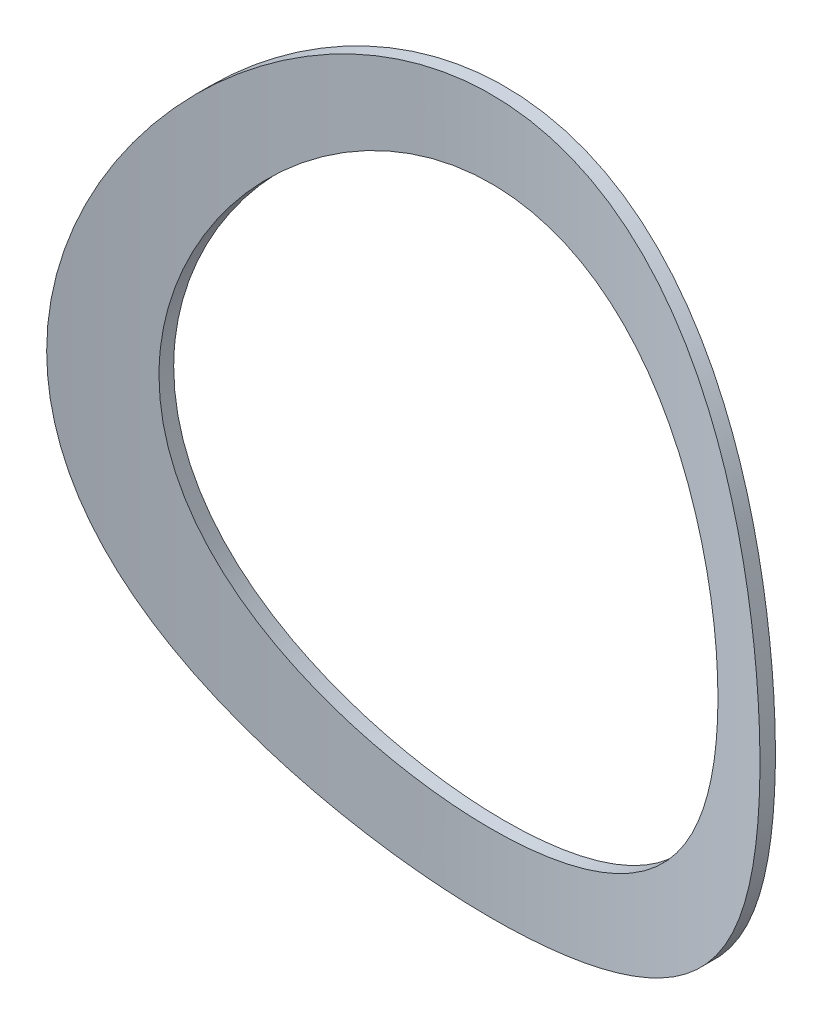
ISO-10303-21;
HEADER;
FILE_DESCRIPTION(('STEP AP214'),'2;1');
FILE_NAME('part.step','',(''),(''),'','','');
FILE_SCHEMA(('AUTOMOTIVE_DESIGN { 1 0 10303 214 1 1 1 1 }'));
ENDSEC;
DATA;
#1=APPLICATION_CONTEXT('core data for automotive mechanical design processes');
#2=APPLICATION_PROTOCOL_DEFINITION('international standard','automotive_design',2000,#1);
#3=PRODUCT_CONTEXT('',#1,'mechanical');
#4=PRODUCT('Part','Part','',(#3));
#5=PRODUCT_RELATED_PRODUCT_CATEGORY('part','',(#4));
#6=PRODUCT_DEFINITION_FORMATION('','',#4);
#7=PRODUCT_DEFINITION_CONTEXT('part definition',#1,'design');
#8=PRODUCT_DEFINITION('design','',#6,#7);
#9=PRODUCT_DEFINITION_SHAPE('','',#8);
#10=(LENGTH_UNIT() NAMED_UNIT(*) SI_UNIT(.MILLI.,.METRE.));
#11=(NAMED_UNIT(*) PLANE_ANGLE_UNIT() SI_UNIT($,.RADIAN.));
#12=(NAMED_UNIT(*) SI_UNIT($,.STERADIAN.) SOLID_ANGLE_UNIT());
#13=UNCERTAINTY_MEASURE_WITH_UNIT(LENGTH_MEASURE(1.E-05),#10,'distance_accuracy_value','');
#14=(GEOMETRIC_REPRESENTATION_CONTEXT(3) GLOBAL_UNCERTAINTY_ASSIGNED_CONTEXT((#13)) GLOBAL_UNIT_ASSIGNED_CONTEXT((#10,
#11,#12)) REPRESENTATION_CONTEXT('',''));
#15=CARTESIAN_POINT('',(0.,0.,0.));
#16=DIRECTION('',(0.,0.,1.));
#17=DIRECTION('',(1.,0.,0.));
#18=AXIS2_PLACEMENT_3D('',#15,#16,#17);
#19=CARTESIAN_POINT('',(0.,-330.2,711.2));
#20=DIRECTION('',(0.,1.,0.));
#21=DIRECTION('',(0.,0.,1.));
#22=AXIS2_PLACEMENT_3D('',#19,#20,#21);
#23=CYLINDRICAL_SURFACE('',#22,711.2);
#24=CARTESIAN_POINT('',(-330.2,0.,81.300484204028));
#25=CARTESIAN_POINT('',(-330.19999489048,4.34957566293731,81.3004784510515));
#26=CARTESIAN_POINT('',(-330.114026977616,8.69939716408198,81.2553929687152));
#27=CARTESIAN_POINT('',(-329.77040011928,17.3908860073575,81.0754411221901));
#28=CARTESIAN_POINT('',(-329.512716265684,21.7325520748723,80.9405617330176));
#29=CARTESIAN_POINT('',(-328.826306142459,30.4008496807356,80.58216764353));
#30=CARTESIAN_POINT('',(-328.397495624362,34.7274727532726,80.3586092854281));
#31=CARTESIAN_POINT('',(-327.370217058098,43.3549644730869,79.8249009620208));
#32=CARTESIAN_POINT('',(-326.771755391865,47.6558340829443,79.5147542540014));
#33=CARTESIAN_POINT('',(-325.405573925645,56.2330065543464,78.8098954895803));
#34=CARTESIAN_POINT('',(-324.637498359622,60.5092380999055,78.4150057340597));
#35=CARTESIAN_POINT('',(-322.935108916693,69.0202114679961,77.5445186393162));
#36=CARTESIAN_POINT('',(-322.000793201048,73.2549528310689,77.0689204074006));
#37=CARTESIAN_POINT('',(-319.968733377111,81.6749892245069,76.0411651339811));
#38=CARTESIAN_POINT('',(-318.871011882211,85.8602910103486,75.4890186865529));
#39=CARTESIAN_POINT('',(-316.515009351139,94.1751611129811,74.3127084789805));
#40=CARTESIAN_POINT('',(-315.256728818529,98.3047296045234,73.6885449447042));
#41=CARTESIAN_POINT('',(-312.589194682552,106.482127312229,72.3763672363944));
#42=CARTESIAN_POINT('',(-311.180692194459,110.530253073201,71.6886728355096));
#43=CARTESIAN_POINT('',(-308.21112398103,118.559113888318,70.2522149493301));
#44=CARTESIAN_POINT('',(-306.650058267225,122.539848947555,69.5034514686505));
#45=CARTESIAN_POINT('',(-303.378819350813,130.428387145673,67.9504296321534));
#46=CARTESIAN_POINT('',(-301.668650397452,134.336192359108,67.1461728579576));
#47=CARTESIAN_POINT('',(-298.102469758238,142.074305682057,65.4878160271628));
#48=CARTESIAN_POINT('',(-296.246445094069,145.904606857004,64.6337115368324));
#49=CARTESIAN_POINT('',(-292.392696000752,153.481634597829,62.8818451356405));
#50=CARTESIAN_POINT('',(-290.395010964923,157.228384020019,61.9840953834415));
#51=CARTESIAN_POINT('',(-286.260786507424,164.635331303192,60.1506042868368));
#52=CARTESIAN_POINT('',(-284.124236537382,168.295522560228,59.2148600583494));
#53=CARTESIAN_POINT('',(-279.71586356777,175.52492696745,57.3114471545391));
#54=CARTESIAN_POINT('',(-277.444042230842,179.094141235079,56.3437788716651));
#55=CARTESIAN_POINT('',(-272.768467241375,186.137777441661,54.3824985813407));
#56=CARTESIAN_POINT('',(-270.364712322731,189.612198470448,53.388886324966));
#57=CARTESIAN_POINT('',(-265.254124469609,196.704654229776,51.3107467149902));
#58=CARTESIAN_POINT('',(-262.537878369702,200.315482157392,50.2247572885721));
#59=CARTESIAN_POINT('',(-256.962194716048,207.419522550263,48.0372461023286));
#60=CARTESIAN_POINT('',(-254.102766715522,210.912742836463,46.9357253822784));
#61=CARTESIAN_POINT('',(-248.244205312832,217.777914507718,44.7241498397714));
#62=CARTESIAN_POINT('',(-245.245056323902,221.149852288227,43.6140940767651));
#63=CARTESIAN_POINT('',(-239.111590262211,227.767510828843,41.3927704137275));
#64=CARTESIAN_POINT('',(-235.977284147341,231.01324178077,40.2815026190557));
#65=CARTESIAN_POINT('',(-229.57580294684,237.376001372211,38.0641520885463));
#66=CARTESIAN_POINT('',(-226.308566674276,240.492969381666,36.9580720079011));
#67=CARTESIAN_POINT('',(-219.64669599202,246.592304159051,34.7585218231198));
#68=CARTESIAN_POINT('',(-216.252061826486,249.574671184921,33.6650516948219));
#69=CARTESIAN_POINT('',(-209.339490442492,255.400566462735,31.4974633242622));
#70=CARTESIAN_POINT('',(-205.821549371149,258.244090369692,30.4233456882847));
#71=CARTESIAN_POINT('',(-198.666880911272,263.787776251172,28.3011541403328));
#72=CARTESIAN_POINT('',(-195.030153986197,266.48793878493,27.253080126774));
#73=CARTESIAN_POINT('',(-187.434335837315,271.888452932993,25.1313285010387));
#74=CARTESIAN_POINT('',(-183.468626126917,274.580244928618,24.059534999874));
#75=CARTESIAN_POINT('',(-175.415501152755,279.793584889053,21.9597243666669));
#76=CARTESIAN_POINT('',(-171.328084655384,282.315131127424,20.9317076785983));
#77=CARTESIAN_POINT('',(-163.037505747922,287.182728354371,18.9266430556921));
#78=CARTESIAN_POINT('',(-158.834336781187,289.528769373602,17.9495980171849));
#79=CARTESIAN_POINT('',(-150.319145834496,294.03980773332,16.053526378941));
#80=CARTESIAN_POINT('',(-146.00712430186,296.20480581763,15.1344995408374));
#81=CARTESIAN_POINT('',(-137.283177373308,300.347593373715,13.3614991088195));
#82=CARTESIAN_POINT('',(-132.871293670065,302.325459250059,12.5074989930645));
#83=CARTESIAN_POINT('',(-123.95363381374,306.089790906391,10.8704437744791));
#84=CARTESIAN_POINT('',(-119.447857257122,307.876255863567,10.087388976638));
#85=CARTESIAN_POINT('',(-110.351098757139,311.252648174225,8.59818144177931));
#86=CARTESIAN_POINT('',(-105.760122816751,312.842589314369,7.89202331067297));
#87=CARTESIAN_POINT('',(-96.5016505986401,315.821339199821,6.56197807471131));
#88=CARTESIAN_POINT('',(-91.8341555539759,317.210151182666,5.93808964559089));
#89=CARTESIAN_POINT('',(-82.7274026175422,319.70155065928,4.81389803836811));
#90=CARTESIAN_POINT('',(-78.2922135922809,320.81663401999,4.3082949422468));
#91=CARTESIAN_POINT('',(-69.3713507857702,322.863124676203,3.37716432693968));
#92=CARTESIAN_POINT('',(-64.8856776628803,323.794534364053,2.95163576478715));
#93=CARTESIAN_POINT('',(-55.8726684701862,325.4708827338,2.18368117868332));
#94=CARTESIAN_POINT('',(-51.3453334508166,326.215826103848,1.84125306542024));
#95=CARTESIAN_POINT('',(-42.2579672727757,327.516980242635,1.24194576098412));
#96=CARTESIAN_POINT('',(-37.6979360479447,328.073190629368,0.985066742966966));
#97=CARTESIAN_POINT('',(-28.5565509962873,328.994920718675,0.558817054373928));
#98=CARTESIAN_POINT('',(-23.9752072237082,329.36052263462,0.389408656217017));
#99=CARTESIAN_POINT('',(-14.7988157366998,329.900226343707,0.139171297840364));
#100=CARTESIAN_POINT('',(-10.2037679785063,330.074327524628,0.0583426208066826));
#101=CARTESIAN_POINT('',(-1.00991222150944,330.230460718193,-0.0141396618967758));
#102=CARTESIAN_POINT('',(3.58889560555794,330.212501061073,-0.00579713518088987));
#103=CARTESIAN_POINT('',(12.7806758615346,329.984588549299,0.099994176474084));
#104=CARTESIAN_POINT('',(17.3736483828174,329.774638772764,0.197441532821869));
#105=CARTESIAN_POINT('',(26.1984251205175,329.186478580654,0.47004015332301));
#106=CARTESIAN_POINT('',(30.4313603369,328.822142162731,0.638781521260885));
#107=CARTESIAN_POINT('',(38.8763904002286,327.930928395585,1.05076392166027));
#108=CARTESIAN_POINT('',(43.0884855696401,327.404053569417,1.29400379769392));
#109=CARTESIAN_POINT('',(51.4842253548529,326.189216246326,1.85345970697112));
#110=CARTESIAN_POINT('',(55.6678716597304,325.501263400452,2.16967136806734));
#111=CARTESIAN_POINT('',(63.9998177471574,323.966059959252,2.87313860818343));
#112=CARTESIAN_POINT('',(68.1481173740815,323.118808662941,3.26039449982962));
#113=CARTESIAN_POINT('',(76.4025315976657,321.267154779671,4.10360953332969));
#114=CARTESIAN_POINT('',(80.5086451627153,320.262748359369,4.55957035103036));
#115=CARTESIAN_POINT('',(88.6719542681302,318.099284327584,5.53745762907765));
#116=CARTESIAN_POINT('',(92.7291498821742,316.940226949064,6.05938399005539));
#117=CARTESIAN_POINT('',(100.788425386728,314.470184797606,7.16613850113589));
#118=CARTESIAN_POINT('',(104.79050392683,313.159196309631,7.75096818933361));
#119=CARTESIAN_POINT('',(112.733484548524,310.388295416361,8.98012540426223));
#120=CARTESIAN_POINT('',(116.674386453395,308.928382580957,9.62445310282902));
#121=CARTESIAN_POINT('',(124.547591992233,305.839964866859,10.9789423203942));
#122=CARTESIAN_POINT('',(128.478893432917,304.20927291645,11.6899414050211));
#123=CARTESIAN_POINT('',(136.267174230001,300.80120604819,13.1653259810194));
#124=CARTESIAN_POINT('',(140.124153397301,299.023830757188,13.9297116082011));
#125=CARTESIAN_POINT('',(147.758586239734,295.325972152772,15.5075149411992));
#126=CARTESIAN_POINT('',(151.536040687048,293.405490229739,16.3209321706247));
#127=CARTESIAN_POINT('',(159.006638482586,289.425020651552,17.9922533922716));
#128=CARTESIAN_POINT('',(162.699781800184,287.365032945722,18.8501574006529));
#129=CARTESIAN_POINT('',(169.998237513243,283.108619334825,20.6059580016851));
#130=CARTESIAN_POINT('',(173.603525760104,280.91215649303,21.5038654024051));
#131=CARTESIAN_POINT('',(180.720988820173,276.386953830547,23.3345576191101));
#132=CARTESIAN_POINT('',(184.233163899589,274.058214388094,24.2673423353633));
#133=CARTESIAN_POINT('',(191.16057183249,269.271982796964,26.1627953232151));
#134=CARTESIAN_POINT('',(194.575800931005,266.814485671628,27.125464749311));
#135=CARTESIAN_POINT('',(201.305445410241,261.774389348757,29.0755018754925));
#136=CARTESIAN_POINT('',(204.619859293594,259.191788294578,30.0628699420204));
#137=CARTESIAN_POINT('',(211.419667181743,253.681878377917,32.1412047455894));
#138=CARTESIAN_POINT('',(214.895878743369,250.74387377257,33.2338812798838));
#139=CARTESIAN_POINT('',(221.721142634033,244.729371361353,35.4352235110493));
#140=CARTESIAN_POINT('',(225.07019319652,241.652871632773,36.5438894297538));
#141=CARTESIAN_POINT('',(231.636896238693,235.36578047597,38.7702207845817));
#142=CARTESIAN_POINT('',(234.854548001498,232.155188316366,39.8878862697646));
#143=CARTESIAN_POINT('',(241.154531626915,225.604045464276,42.1251859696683));
#144=CARTESIAN_POINT('',(244.236853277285,222.263484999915,43.2448203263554));
#145=CARTESIAN_POINT('',(250.263419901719,215.45519158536,45.4793420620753));
#146=CARTESIAN_POINT('',(253.207591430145,211.987392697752,46.5942266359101));
#147=CARTESIAN_POINT('',(258.952047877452,204.930661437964,48.8113258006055));
#148=CARTESIAN_POINT('',(261.752332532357,201.34172884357,49.9135403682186));
#149=CARTESIAN_POINT('',(267.205082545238,194.046957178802,52.0979512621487));
#150=CARTESIAN_POINT('',(269.857538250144,190.34111049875,53.1801462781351));
#151=CARTESIAN_POINT('',(275.010053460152,182.817659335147,55.3168635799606));
#152=CARTESIAN_POINT('',(277.510125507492,179.000064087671,56.3713881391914));
#153=CARTESIAN_POINT('',(282.472647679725,171.067791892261,58.4961761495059));
#154=CARTESIAN_POINT('',(284.927246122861,166.94772549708,59.5646771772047));
#155=CARTESIAN_POINT('',(289.659428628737,158.595379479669,61.6543541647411));
#156=CARTESIAN_POINT('',(291.937011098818,154.363098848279,62.675529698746));
#157=CARTESIAN_POINT('',(296.310262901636,145.792368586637,64.6619603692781));
#158=CARTESIAN_POINT('',(298.405921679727,141.453912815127,65.6272122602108));
#159=CARTESIAN_POINT('',(302.410125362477,132.677875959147,67.4932068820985));
#160=CARTESIAN_POINT('',(304.31867106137,128.240295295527,68.393949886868));
#161=CARTESIAN_POINT('',(307.942327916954,119.27663168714,70.1220097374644));
#162=CARTESIAN_POINT('',(309.657578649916,114.750615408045,70.9493794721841));
#163=CARTESIAN_POINT('',(312.891352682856,105.614962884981,72.5234966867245));
#164=CARTESIAN_POINT('',(314.409875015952,101.005326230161,73.2702437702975));
#165=CARTESIAN_POINT('',(317.245355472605,91.7116418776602,74.6755868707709));
#166=CARTESIAN_POINT('',(318.562331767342,87.0276009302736,75.3341908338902));
#167=CARTESIAN_POINT('',(320.990483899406,77.5942565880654,76.5564798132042));
#168=CARTESIAN_POINT('',(322.101663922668,72.8449545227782,77.1201667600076));
#169=CARTESIAN_POINT('',(324.039479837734,63.6464879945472,78.1084204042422));
#170=CARTESIAN_POINT('',(324.881127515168,59.2012567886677,78.5402139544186));
#171=CARTESIAN_POINT('',(326.382029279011,50.2723044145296,79.3132030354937));
#172=CARTESIAN_POINT('',(327.041286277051,45.7885838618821,79.6544000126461));
#173=CARTESIAN_POINT('',(328.17518731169,36.7918783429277,80.2428741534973));
#174=CARTESIAN_POINT('',(328.649837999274,32.2788944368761,80.4901547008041));
#175=CARTESIAN_POINT('',(329.412921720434,23.2329445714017,80.8883687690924));
#176=CARTESIAN_POINT('',(329.701354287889,18.6999785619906,81.0393020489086));
#177=CARTESIAN_POINT('',(330.090893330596,9.62580450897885,81.2432629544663));
#178=CARTESIAN_POINT('',(330.192082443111,5.08460098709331,81.2963337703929));
#179=CARTESIAN_POINT('',(330.207023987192,-3.99821889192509,81.3041662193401));
#180=CARTESIAN_POINT('',(330.120775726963,-8.53983525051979,81.2589274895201));
#181=CARTESIAN_POINT('',(329.761159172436,-17.6134053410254,81.0706014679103));
#182=CARTESIAN_POINT('',(329.487799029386,-22.1453594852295,80.9275184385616));
#183=CARTESIAN_POINT('',(328.754933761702,-31.190038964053,80.5449401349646));
#184=CARTESIAN_POINT('',(328.295432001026,-35.7027646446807,80.3054466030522));
#185=CARTESIAN_POINT('',(327.240448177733,-44.3036635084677,79.7576438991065));
#186=CARTESIAN_POINT('',(326.66048735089,-48.3942565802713,79.4572433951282));
#187=CARTESIAN_POINT('',(325.348705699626,-56.5446407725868,78.7806735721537));
#188=CARTESIAN_POINT('',(324.616887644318,-60.604432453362,78.404505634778));
#189=CARTESIAN_POINT('',(323.003417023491,-68.6863289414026,77.5794091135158));
#190=CARTESIAN_POINT('',(322.121775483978,-72.7084364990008,77.1304858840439));
#191=CARTESIAN_POINT('',(320.210884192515,-80.7090146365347,76.1633269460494));
#192=CARTESIAN_POINT('',(319.181633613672,-84.6874849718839,75.6450908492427));
#193=CARTESIAN_POINT('',(316.97783408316,-92.595598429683,74.5430983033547));
#194=CARTESIAN_POINT('',(315.803257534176,-96.5252321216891,73.9593294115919));
#195=CARTESIAN_POINT('',(313.31167407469,-104.329349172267,72.7306083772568));
#196=CARTESIAN_POINT('',(311.994667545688,-108.203832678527,72.0856563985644));
#197=CARTESIAN_POINT('',(309.221018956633,-115.892643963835,70.7390895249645));
#198=CARTESIAN_POINT('',(307.764371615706,-119.706969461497,70.0374724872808));
#199=CARTESIAN_POINT('',(304.714411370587,-127.270560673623,68.5823670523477));
#200=CARTESIAN_POINT('',(303.121096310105,-131.019825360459,67.8288778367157));
#201=CARTESIAN_POINT('',(299.724728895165,-138.61901787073,66.2393799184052));
#202=CARTESIAN_POINT('',(297.915411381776,-142.465686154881,65.4011720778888));
#203=CARTESIAN_POINT('',(294.154042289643,-150.078194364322,63.6792533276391));
#204=CARTESIAN_POINT('',(292.201989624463,-153.844033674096,62.7955420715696));
#205=CARTESIAN_POINT('',(288.158668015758,-161.290329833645,60.988553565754));
#206=CARTESIAN_POINT('',(286.067403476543,-164.970789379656,60.0652775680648));
#207=CARTESIAN_POINT('',(281.748864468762,-172.242564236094,58.1850201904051));
#208=CARTESIAN_POINT('',(279.52158018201,-175.833873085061,57.2280363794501));
#209=CARTESIAN_POINT('',(274.933678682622,-182.924438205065,55.2860426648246));
#210=CARTESIAN_POINT('',(272.573013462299,-186.423660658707,54.3010227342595));
#211=CARTESIAN_POINT('',(267.72242141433,-193.324944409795,52.3092512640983));
#212=CARTESIAN_POINT('',(265.232494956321,-196.727005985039,51.3024997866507));
#213=CARTESIAN_POINT('',(260.126439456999,-203.430650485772,49.2730980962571));
#214=CARTESIAN_POINT('',(257.510299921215,-206.732225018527,48.2504465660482));
#215=CARTESIAN_POINT('',(252.15544315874,-213.230857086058,46.1952656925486));
#216=CARTESIAN_POINT('',(249.41673330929,-216.42792089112,45.1627369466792));
#217=CARTESIAN_POINT('',(243.524076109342,-223.046442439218,42.9842069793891));
#218=CARTESIAN_POINT('',(240.356828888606,-226.455920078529,41.8377428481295));
#219=CARTESIAN_POINT('',(233.880590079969,-233.138499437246,39.5474807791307));
#220=CARTESIAN_POINT('',(230.571596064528,-236.411598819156,38.4036828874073));
#221=CARTESIAN_POINT('',(223.816120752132,-242.81690910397,36.1263075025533));
#222=CARTESIAN_POINT('',(220.369630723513,-245.949111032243,34.9927306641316));
#223=CARTESIAN_POINT('',(213.343940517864,-252.067653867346,32.7433633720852));
#224=CARTESIAN_POINT('',(209.764740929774,-255.053995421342,31.6275728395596));
#225=CARTESIAN_POINT('',(202.477485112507,-260.876723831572,29.420853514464));
#226=CARTESIAN_POINT('',(198.769398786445,-263.713075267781,28.3299306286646));
#227=CARTESIAN_POINT('',(191.230125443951,-269.230196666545,26.18040602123));
#228=CARTESIAN_POINT('',(187.398938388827,-271.910966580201,25.1218043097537));
#229=CARTESIAN_POINT('',(179.618749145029,-277.111962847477,23.0439445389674));
#230=CARTESIAN_POINT('',(175.66974801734,-279.632190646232,22.0246861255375));
#231=CARTESIAN_POINT('',(167.659497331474,-284.507144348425,20.0323169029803));
#232=CARTESIAN_POINT('',(163.598247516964,-286.861869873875,19.0592061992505));
#233=CARTESIAN_POINT('',(155.311540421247,-291.432788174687,17.15238284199));
#234=CARTESIAN_POINT('',(151.084575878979,-293.646562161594,16.2194182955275));
#235=CARTESIAN_POINT('',(142.528145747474,-297.893571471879,14.4143191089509));
#236=CARTESIAN_POINT('',(138.198679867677,-299.926806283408,13.5421846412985));
#237=CARTESIAN_POINT('',(129.444387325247,-303.807695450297,11.8649919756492));
#238=CARTESIAN_POINT('',(125.019557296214,-305.655343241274,11.0599361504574));
#239=CARTESIAN_POINT('',(116.082554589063,-309.160020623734,9.52283908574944));
#240=CARTESIAN_POINT('',(111.570382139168,-310.817050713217,8.79079765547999));
#241=CARTESIAN_POINT('',(102.469891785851,-313.934836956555,7.40561781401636));
#242=CARTESIAN_POINT('',(97.8816217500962,-315.395711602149,6.75243179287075));
#243=CARTESIAN_POINT('',(88.6352592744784,-318.117992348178,5.52941248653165));
#244=CARTESIAN_POINT('',(83.97716648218,-319.379397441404,4.95957962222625));
#245=CARTESIAN_POINT('',(74.6011534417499,-321.69866055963,3.90772657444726));
#246=CARTESIAN_POINT('',(69.8832379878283,-322.756534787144,3.42569940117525));
#247=CARTESIAN_POINT('',(60.3973824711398,-324.665367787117,2.55320504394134));
#248=CARTESIAN_POINT('',(55.6294434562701,-325.516330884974,2.16273594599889));
#249=CARTESIAN_POINT('',(46.4512190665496,-326.946587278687,1.50492270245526));
#250=CARTESIAN_POINT('',(42.0440628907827,-327.542557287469,1.23005341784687));
#251=CARTESIAN_POINT('',(33.2050336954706,-328.556317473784,0.76178923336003));
#252=CARTESIAN_POINT('',(28.7731611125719,-328.974110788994,0.568392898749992));
#253=CARTESIAN_POINT('',(19.8935349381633,-329.630256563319,0.264404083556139));
#254=CARTESIAN_POINT('',(15.4457821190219,-329.868617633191,0.153807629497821));
#255=CARTESIAN_POINT('',(6.54296021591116,-330.165211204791,0.0161634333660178));
#256=CARTESIAN_POINT('',(2.08789110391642,-330.223443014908,-0.0108839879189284));
#257=CARTESIAN_POINT('',(-6.81965085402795,-330.159605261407,0.0187543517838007));
#258=CARTESIAN_POINT('',(-11.2721240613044,-330.03757711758,0.0754208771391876));
#259=CARTESIAN_POINT('',(-20.1666587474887,-329.613666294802,0.272061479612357));
#260=CARTESIAN_POINT('',(-24.6087202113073,-329.311783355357,0.412035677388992));
#261=CARTESIAN_POINT('',(-33.4735921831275,-328.529082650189,0.774326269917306));
#262=CARTESIAN_POINT('',(-37.8964029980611,-328.048267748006,0.996641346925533));
#263=CARTESIAN_POINT('',(-46.714235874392,-326.909135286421,1.52209608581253));
#264=CARTESIAN_POINT('',(-51.1092582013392,-326.25081942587,1.82523497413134));
#265=CARTESIAN_POINT('',(-59.6372089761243,-324.797129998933,2.49259842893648));
#266=CARTESIAN_POINT('',(-63.7719564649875,-324.010584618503,2.85286240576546));
#267=CARTESIAN_POINT('',(-72.0020661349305,-322.281589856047,3.64206493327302));
#268=CARTESIAN_POINT('',(-76.0974287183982,-321.339142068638,4.07100278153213));
#269=CARTESIAN_POINT('',(-84.2419894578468,-319.300718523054,4.99498468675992));
#270=CARTESIAN_POINT('',(-88.2911898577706,-318.204750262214,5.49002551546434));
#271=CARTESIAN_POINT('',(-96.3373502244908,-315.861856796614,6.54333343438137));
#272=CARTESIAN_POINT('',(-100.33431001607,-314.614931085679,7.10160073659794));
#273=CARTESIAN_POINT('',(-108.27035431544,-311.972855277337,8.27819542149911));
#274=CARTESIAN_POINT('',(-112.209433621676,-310.577691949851,8.89652816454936));
#275=CARTESIAN_POINT('',(-120.023701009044,-307.642277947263,10.1897039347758));
#276=CARTESIAN_POINT('',(-123.898889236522,-306.102027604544,10.8645468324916));
#277=CARTESIAN_POINT('',(-131.580210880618,-302.879572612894,12.2670052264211));
#278=CARTESIAN_POINT('',(-135.38634196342,-301.197363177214,12.9946225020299));
#279=CARTESIAN_POINT('',(-142.924454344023,-297.694330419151,14.4986205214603));
#280=CARTESIAN_POINT('',(-146.656435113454,-295.873506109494,15.2750016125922));
#281=CARTESIAN_POINT('',(-154.209310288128,-292.010835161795,16.9086149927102));
#282=CARTESIAN_POINT('',(-158.02654482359,-289.962706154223,17.7679178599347));
#283=CARTESIAN_POINT('',(-165.56990115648,-285.722537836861,19.5302446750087));
#284=CARTESIAN_POINT('',(-169.296022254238,-283.530497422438,20.4332689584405));
#285=CARTESIAN_POINT('',(-176.652523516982,-279.006402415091,22.2778662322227));
#286=CARTESIAN_POINT('',(-180.282902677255,-276.674346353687,23.2194396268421));
#287=CARTESIAN_POINT('',(-187.443512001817,-271.874141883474,25.1357852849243));
#288=CARTESIAN_POINT('',(-190.97374226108,-269.405993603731,26.1105575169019));
#289=CARTESIAN_POINT('',(-197.931208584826,-264.336546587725,28.088178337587));
#290=CARTESIAN_POINT('',(-201.358406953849,-261.735200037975,29.0910369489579));
#291=CARTESIAN_POINT('',(-208.104565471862,-256.404003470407,31.1188756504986));
#292=CARTESIAN_POINT('',(-211.423525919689,-253.674153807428,32.1438556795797));
#293=CARTESIAN_POINT('',(-217.949489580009,-248.089708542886,34.2102108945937));
#294=CARTESIAN_POINT('',(-221.156492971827,-245.23511314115,35.2515860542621));
#295=CARTESIAN_POINT('',(-227.455216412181,-239.404644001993,37.3449859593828));
#296=CARTESIAN_POINT('',(-230.546926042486,-236.428759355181,38.3970116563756));
#297=CARTESIAN_POINT('',(-236.873479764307,-230.097190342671,40.5968691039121));
#298=CARTESIAN_POINT('',(-240.097587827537,-226.730914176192,41.7451200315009));
#299=CARTESIAN_POINT('',(-246.400818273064,-219.864496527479,44.0393552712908));
#300=CARTESIAN_POINT('',(-249.479939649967,-216.364354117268,45.1853395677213));
#301=CARTESIAN_POINT('',(-255.489013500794,-209.234654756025,47.4672722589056));
#302=CARTESIAN_POINT('',(-258.418955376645,-205.605088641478,48.6032199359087));
#303=CARTESIAN_POINT('',(-264.125005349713,-198.221568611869,50.8570349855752));
#304=CARTESIAN_POINT('',(-266.901114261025,-194.467615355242,51.974902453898));
#305=CARTESIAN_POINT('',(-272.297062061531,-186.837363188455,54.1853448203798));
#306=CARTESIAN_POINT('',(-274.916783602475,-182.96097566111,55.277900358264));
#307=CARTESIAN_POINT('',(-279.993260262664,-175.093493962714,57.4287755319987));
#308=CARTESIAN_POINT('',(-282.450010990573,-171.102396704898,58.4870942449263));
#309=CARTESIAN_POINT('',(-287.195861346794,-163.010967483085,60.5613261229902));
#310=CARTESIAN_POINT('',(-289.484961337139,-158.910635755,61.5772393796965));
#311=CARTESIAN_POINT('',(-293.89061709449,-150.606883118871,63.5584488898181));
#312=CARTESIAN_POINT('',(-296.007190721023,-146.403472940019,64.5237503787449));
#313=CARTESIAN_POINT('',(-300.088650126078,-137.846262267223,66.4075084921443));
#314=CARTESIAN_POINT('',(-302.051315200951,-133.491240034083,67.325230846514));
#315=CARTESIAN_POINT('',(-305.79034483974,-124.688302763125,69.092546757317));
#316=CARTESIAN_POINT('',(-307.566708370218,-120.240387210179,69.9421399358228));
#317=CARTESIAN_POINT('',(-310.928632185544,-111.25836810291,71.56548608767));
#318=CARTESIAN_POINT('',(-312.514156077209,-106.724248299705,72.3392245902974));
#319=CARTESIAN_POINT('',(-315.489323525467,-97.5789323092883,73.8032035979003));
#320=CARTESIAN_POINT('',(-316.87896998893,-92.9677372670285,74.4934453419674));
#321=CARTESIAN_POINT('',(-319.454163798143,-83.6909818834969,75.781598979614));
#322=CARTESIAN_POINT('',(-320.640306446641,-79.0256242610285,76.3797796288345));
#323=CARTESIAN_POINT('',(-322.809575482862,-69.6364403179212,77.4801108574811));
#324=CARTESIAN_POINT('',(-323.792692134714,-64.9126112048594,77.9822568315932));
#325=CARTESIAN_POINT('',(-325.551740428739,-55.4201270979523,78.8848246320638));
#326=CARTESIAN_POINT('',(-326.327806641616,-50.6515033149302,79.2853125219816));
#327=CARTESIAN_POINT('',(-327.670572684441,-41.0778804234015,79.9805378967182));
#328=CARTESIAN_POINT('',(-328.23731167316,-36.2728882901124,80.2752951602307));
#329=CARTESIAN_POINT('',(-328.948251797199,-28.8439391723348,80.6458278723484));
#330=CARTESIAN_POINT('',(-329.167102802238,-26.2287762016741,80.7600722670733));
#331=CARTESIAN_POINT('',(-329.54241835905,-20.993323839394,80.9561740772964));
#332=CARTESIAN_POINT('',(-329.69889752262,-18.373035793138,81.0380390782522));
#333=CARTESIAN_POINT('',(-329.949350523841,-13.1285332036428,81.1691388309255));
#334=CARTESIAN_POINT('',(-330.043321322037,-10.5043184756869,81.2183719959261));
#335=CARTESIAN_POINT('',(-330.168654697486,-5.25343266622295,81.2840501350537));
#336=CARTESIAN_POINT('',(-330.200003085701,-2.62676116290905,81.3004876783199));
#337=CARTESIAN_POINT('',(-330.2,0.,81.300484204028));
#338=B_SPLINE_CURVE_WITH_KNOTS('',3,(#24,#25,#26,#27,#28,#29,#30,#31,#32,#33,#34,#35,#36,#37,
#38,#39,#40,#41,#42,#43,#44,#45,#46,#47,#48,#49,#50,#51,#52,#53,#54,#55,#56,#57,#58,#59,#60,#61,
#62,#63,#64,#65,#66,#67,#68,#69,#70,#71,#72,#73,#74,#75,#76,#77,#78,#79,#80,#81,#82,#83,#84,#85,
#86,#87,#88,#89,#90,#91,#92,#93,#94,#95,#96,#97,#98,#99,#100,#101,#102,#103,#104,#105,#106,#107,
#108,#109,#110,#111,#112,#113,#114,#115,#116,#117,#118,#119,#120,#121,#122,#123,#124,#125,#126,
#127,#128,#129,#130,#131,#132,#133,#134,#135,#136,#137,#138,#139,#140,#141,#142,#143,#144,#145,
#146,#147,#148,#149,#150,#151,#152,#153,#154,#155,#156,#157,#158,#159,#160,#161,#162,#163,#164,
#165,#166,#167,#168,#169,#170,#171,#172,#173,#174,#175,#176,#177,#178,#179,#180,#181,#182,#183,
#184,#185,#186,#187,#188,#189,#190,#191,#192,#193,#194,#195,#196,#197,#198,#199,#200,#201,#202,
#203,#204,#205,#206,#207,#208,#209,#210,#211,#212,#213,#214,#215,#216,#217,#218,#219,#220,#221,
#222,#223,#224,#225,#226,#227,#228,#229,#230,#231,#232,#233,#234,#235,#236,#237,#238,#239,#240,
#241,#242,#243,#244,#245,#246,#247,#248,#249,#250,#251,#252,#253,#254,#255,#256,#257,#258,#259,
#260,#261,#262,#263,#264,#265,#266,#267,#268,#269,#270,#271,#272,#273,#274,#275,#276,#277,#278,
#279,#280,#281,#282,#283,#284,#285,#286,#287,#288,#289,#290,#291,#292,#293,#294,#295,#296,#297,
#298,#299,#300,#301,#302,#303,#304,#305,#306,#307,#308,#309,#310,#311,#312,#313,#314,#315,#316,
#317,#318,#319,#320,#321,#322,#323,#324,#325,#326,#327,#328,#329,#330,#331,#332,#333,#334,#335,
#336,#337),.UNSPECIFIED.,.T.,.F.,(4,2,2,2,2,2,2,2,2,2,2,2,2,2,2,2,2,2,2,2,2,2,2,2,2,2,2,2,2,2,2,
2,2,2,2,2,2,2,2,2,2,2,2,2,2,2,2,2,2,2,2,2,2,2,2,2,2,2,2,2,2,2,2,2,2,2,2,2,2,2,2,2,2,2,2,2,2,2,2,
2,2,2,2,2,2,2,2,2,2,2,2,2,2,2,2,2,2,2,2,2,2,2,2,2,2,2,2,2,2,2,2,2,2,2,2,2,2,2,2,2,2,2,2,2,2,2,2,
2,2,2,2,2,2,2,2,2,2,2,2,2,2,2,2,2,2,2,2,2,2,2,2,2,2,2,2,2,4),(0.,13.0480720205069,
26.0980371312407,39.15443489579,52.2103415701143,65.2938976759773,78.3775985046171,
91.4594903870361,104.541341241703,117.560603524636,130.579864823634,143.598755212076,
156.618805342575,169.635248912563,182.652682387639,195.669955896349,208.687354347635,
222.624836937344,236.561390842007,250.499503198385,264.436487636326,278.37996141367,
292.323408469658,306.267291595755,320.211120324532,334.940518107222,349.670065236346,
364.400448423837,379.130771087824,393.855053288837,408.579398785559,423.30271074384,
438.025785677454,451.824485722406,465.623006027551,479.421179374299,493.219380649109,
507.011625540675,520.803914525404,534.595605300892,548.38707496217,561.139112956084,
573.89095301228,586.642029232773,599.393161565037,612.144604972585,624.896029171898,
637.647765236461,650.399538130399,663.341227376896,676.282949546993,689.224545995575,
702.166147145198,715.111266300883,728.056348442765,741.001931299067,753.947706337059,
767.986218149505,782.024924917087,796.063708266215,810.103549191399,824.150771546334,
838.198019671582,852.246183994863,866.293190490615,881.028775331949,895.764492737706,
910.50106449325,925.237573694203,939.963372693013,954.689244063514,969.413786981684,
984.138030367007,997.767717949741,1011.39718793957,1025.02616684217,1038.65517985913,
1052.27817646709,1065.90122335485,1079.52367681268,1093.14588409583,1105.56955150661,
1117.9929923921,1130.41551939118,1142.83811598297,1155.2630752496,1167.68800123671,
1180.11339728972,1192.538989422,1205.53394502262,1218.52899954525,1231.52364313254,
1244.51922581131,1257.51951615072,1270.51976931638,1283.5211053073,1296.52165982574,
1310.8957789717,1325.27014438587,1339.64542409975,1354.02064002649,1368.39923562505,
1382.77783574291,1397.15630641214,1411.53480991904,1426.11586322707,1440.69695787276,
1455.27856808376,1469.86014019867,1484.43286400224,1499.00566138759,1513.57729819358,
1528.14863035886,1541.51161363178,1554.87436157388,1568.2364682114,1581.59862615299,
1594.95771424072,1608.31682167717,1621.67571533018,1635.0344811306,1647.70372590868,
1660.37284110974,1673.0413378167,1685.7098770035,1698.3795477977,1711.04918956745,
1723.71925871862,1736.38941811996,1749.63502266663,1762.88072889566,1776.12657406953,
1789.37240668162,1802.62302787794,1815.87361248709,1829.12417587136,1842.37593372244,
1856.77343446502,1871.17103503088,1885.56965701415,1899.9682027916,1914.37742039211,
1928.7870260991,1943.19660068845,1957.60468173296,1972.19243345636,1986.78026609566,
2001.3708762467,2015.96126984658,2030.50822669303,2045.05588095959,2059.59405693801,
2074.12951188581,2082.00907900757,2089.88679910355,2097.76490222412,2105.6447901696),.UNSPECIFIED.);
#339=CARTESIAN_POINT('',(-330.2,0.,81.300484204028));
#340=VERTEX_POINT('',#339);
#341=EDGE_CURVE('E50',#340,#340,#338,.T.);
#342=ORIENTED_EDGE('',*,*,#341,.F.);
#343=EDGE_LOOP('',(#342));
#344=FACE_BOUND('',#343,.T.);
#345=CARTESIAN_POINT('',(-258.7625,0.,48.7444100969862));
#346=CARTESIAN_POINT('',(-258.76250152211,-3.50186764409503,48.7444114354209));
#347=CARTESIAN_POINT('',(-258.691398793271,-7.00369239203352,48.7166241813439));
#348=CARTESIAN_POINT('',(-258.407182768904,-14.0006540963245,48.6057113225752));
#349=CARTESIAN_POINT('',(-258.194071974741,-17.4957911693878,48.5225866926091));
#350=CARTESIAN_POINT('',(-257.626419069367,-24.4726093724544,48.3016964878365));
#351=CARTESIAN_POINT('',(-257.271885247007,-27.9542912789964,48.1639341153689));
#352=CARTESIAN_POINT('',(-256.42230692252,-34.8979366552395,47.8349060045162));
#353=CARTESIAN_POINT('',(-255.927261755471,-38.3599000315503,47.6436400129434));
#354=CARTESIAN_POINT('',(-254.797928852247,-45.2577135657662,47.209170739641));
#355=CARTESIAN_POINT('',(-254.163642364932,-48.6935639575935,46.9659679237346));
#356=CARTESIAN_POINT('',(-252.757401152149,-55.5330222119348,46.4295867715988));
#357=CARTESIAN_POINT('',(-251.98544655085,-58.9366301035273,46.1364084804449));
#358=CARTESIAN_POINT('',(-250.305713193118,-65.7057241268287,45.5023992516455));
#359=CARTESIAN_POINT('',(-249.397932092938,-69.0712095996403,45.161567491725));
#360=CARTESIAN_POINT('',(-247.448662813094,-75.7582996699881,44.4349131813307));
#361=CARTESIAN_POINT('',(-246.407174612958,-79.0799042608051,44.0490906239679));
#362=CARTESIAN_POINT('',(-244.195406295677,-85.6660616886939,43.2363571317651));
#363=CARTESIAN_POINT('',(-243.025433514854,-88.930729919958,42.8095445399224));
#364=CARTESIAN_POINT('',(-240.55720001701,-95.4058160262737,41.9172530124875));
#365=CARTESIAN_POINT('',(-239.258939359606,-98.6162339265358,41.4517740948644));
#366=CARTESIAN_POINT('',(-236.53677660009,-104.97787772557,40.4855458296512));
#367=CARTESIAN_POINT('',(-235.112876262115,-108.129104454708,39.984796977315));
#368=CARTESIAN_POINT('',(-232.142161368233,-114.367761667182,38.9515861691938));
#369=CARTESIAN_POINT('',(-230.595346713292,-117.455192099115,38.4191241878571));
#370=CARTESIAN_POINT('',(-227.381369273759,-123.562345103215,37.326099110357));
#371=CARTESIAN_POINT('',(-225.714186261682,-126.582056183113,36.7655312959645));
#372=CARTESIAN_POINT('',(-222.262464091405,-132.549274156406,35.6201425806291));
#373=CARTESIAN_POINT('',(-220.477914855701,-135.496774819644,35.0353195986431));
#374=CARTESIAN_POINT('',(-216.794592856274,-141.315218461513,33.8453735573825));
#375=CARTESIAN_POINT('',(-214.89582245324,-144.186163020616,33.2402509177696));
#376=CARTESIAN_POINT('',(-210.987027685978,-149.847718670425,32.0136412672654));
#377=CARTESIAN_POINT('',(-208.977002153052,-152.638328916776,31.392154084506));
#378=CARTESIAN_POINT('',(-204.761037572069,-158.252297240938,30.1101264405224));
#379=CARTESIAN_POINT('',(-202.550402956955,-161.072007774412,29.4490486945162));
#380=CARTESIAN_POINT('',(-198.015054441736,-166.61601453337,28.1179672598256));
#381=CARTESIAN_POINT('',(-195.690338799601,-169.340309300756,27.447963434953));
#382=CARTESIAN_POINT('',(-190.930520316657,-174.689394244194,26.1035894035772));
#383=CARTESIAN_POINT('',(-188.495421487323,-177.31418802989,25.4292193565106));
#384=CARTESIAN_POINT('',(-183.518155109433,-182.46077559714,24.0805232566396));
#385=CARTESIAN_POINT('',(-180.975976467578,-184.982558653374,23.4061972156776));
#386=CARTESIAN_POINT('',(-175.788029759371,-189.919521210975,22.0619947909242));
#387=CARTESIAN_POINT('',(-173.142241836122,-192.334680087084,21.3921192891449));
#388=CARTESIAN_POINT('',(-167.751685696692,-197.053886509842,20.0614334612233));
#389=CARTESIAN_POINT('',(-165.006928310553,-199.35794614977,19.4006221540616));
#390=CARTESIAN_POINT('',(-159.421822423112,-203.851814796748,18.0922525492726));
#391=CARTESIAN_POINT('',(-156.581463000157,-206.041610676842,17.444695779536));
#392=CARTESIAN_POINT('',(-150.809858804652,-210.302839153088,16.1672227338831));
#393=CARTESIAN_POINT('',(-147.878622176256,-212.374282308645,15.5373048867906));
#394=CARTESIAN_POINT('',(-141.834388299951,-216.459613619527,14.2794333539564));
#395=CARTESIAN_POINT('',(-138.718575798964,-218.469555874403,13.6521837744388));
#396=CARTESIAN_POINT('',(-132.399469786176,-222.355954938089,12.4252298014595));
#397=CARTESIAN_POINT('',(-129.196175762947,-224.232410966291,11.8255255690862));
#398=CARTESIAN_POINT('',(-122.707243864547,-227.848104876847,10.6578957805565));
#399=CARTESIAN_POINT('',(-119.421603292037,-229.587338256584,10.0899712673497));
#400=CARTESIAN_POINT('',(-112.773605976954,-232.92483500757,8.98998512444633));
#401=CARTESIAN_POINT('',(-109.411249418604,-234.523098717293,8.4579234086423));
#402=CARTESIAN_POINT('',(-102.616458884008,-237.574747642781,7.4336297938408));
#403=CARTESIAN_POINT('',(-99.1840422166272,-239.028168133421,6.94138820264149));
#404=CARTESIAN_POINT('',(-92.2544513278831,-241.78721100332,6.00018275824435));
#405=CARTESIAN_POINT('',(-88.7572769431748,-243.092833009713,5.55121901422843));
#406=CARTESIAN_POINT('',(-81.7047683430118,-245.553068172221,4.69990387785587));
#407=CARTESIAN_POINT('',(-78.1494364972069,-246.707687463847,4.29755059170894));
#408=CARTESIAN_POINT('',(-70.9872468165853,-248.863069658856,3.54244372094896));
#409=CARTESIAN_POINT('',(-67.3803894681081,-249.8638340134,3.18968966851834));
#410=CARTESIAN_POINT('',(-60.2704333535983,-251.671225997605,2.54978305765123));
#411=CARTESIAN_POINT('',(-56.7691126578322,-252.484112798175,2.26053975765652));
#412=CARTESIAN_POINT('',(-49.732024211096,-253.963943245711,1.73216054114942));
#413=CARTESIAN_POINT('',(-46.1962567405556,-254.630888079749,1.49302421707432));
#414=CARTESIAN_POINT('',(-39.0969946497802,-255.817137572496,1.0665547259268));
#415=CARTESIAN_POINT('',(-35.5335005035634,-256.336444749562,0.879220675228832));
#416=CARTESIAN_POINT('',(-28.3855671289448,-257.226091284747,0.557685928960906));
#417=CARTESIAN_POINT('',(-24.8011278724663,-257.596430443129,0.423485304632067));
#418=CARTESIAN_POINT('',(-17.6192382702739,-258.18708825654,0.209208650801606));
#419=CARTESIAN_POINT('',(-14.0217915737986,-258.407446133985,0.129118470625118));
#420=CARTESIAN_POINT('',(-6.82002309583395,-258.69771182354,0.0235827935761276));
#421=CARTESIAN_POINT('',(-3.21570130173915,-258.767619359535,-0.00186260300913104));
#422=CARTESIAN_POINT('',(3.99259416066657,-258.756797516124,0.0020747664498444));
#423=CARTESIAN_POINT('',(7.59656783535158,-258.67607183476,0.0314561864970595));
#424=CARTESIAN_POINT('',(14.7971168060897,-258.364205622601,0.144833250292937));
#425=CARTESIAN_POINT('',(18.3936921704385,-258.13306648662,0.228828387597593));
#426=CARTESIAN_POINT('',(25.4047246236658,-257.535288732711,0.445640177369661));
#427=CARTESIAN_POINT('',(28.8198428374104,-257.175482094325,0.57599365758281));
#428=CARTESIAN_POINT('',(35.6308867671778,-256.320602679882,0.884928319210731));
#429=CARTESIAN_POINT('',(39.0268126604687,-255.82553115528,1.06350905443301));
#430=CARTESIAN_POINT('',(45.7934336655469,-254.701305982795,1.46773440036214));
#431=CARTESIAN_POINT('',(49.1641297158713,-254.072157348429,1.69337725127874));
#432=CARTESIAN_POINT('',(55.8746493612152,-252.681215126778,2.1902799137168));
#433=CARTESIAN_POINT('',(59.2144728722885,-251.919421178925,2.46153984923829));
#434=CARTESIAN_POINT('',(65.8577257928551,-250.264878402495,3.04795445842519));
#435=CARTESIAN_POINT('',(69.1611540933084,-249.372125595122,3.36311046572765));
#436=CARTESIAN_POINT('',(75.7260886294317,-247.45763651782,4.03531819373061));
#437=CARTESIAN_POINT('',(78.9875949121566,-246.435900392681,4.39236986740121));
#438=CARTESIAN_POINT('',(85.4635355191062,-244.265588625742,5.14614162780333));
#439=CARTESIAN_POINT('',(88.6779689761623,-243.117010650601,5.5428624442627));
#440=CARTESIAN_POINT('',(95.054710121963,-240.695378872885,6.37351034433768));
#441=CARTESIAN_POINT('',(98.2170176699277,-239.422324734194,6.80743752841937));
#442=CARTESIAN_POINT('',(104.529211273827,-236.735311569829,7.71624380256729));
#443=CARTESIAN_POINT('',(107.678284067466,-235.319609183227,8.19161669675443));
#444=CARTESIAN_POINT('',(113.913146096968,-232.365502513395,9.1749324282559));
#445=CARTESIAN_POINT('',(116.998935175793,-230.827097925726,9.68287534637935));
#446=CARTESIAN_POINT('',(123.102689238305,-227.630463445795,10.7281910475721));
#447=CARTESIAN_POINT('',(126.120654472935,-225.972233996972,11.2655637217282));
#448=CARTESIAN_POINT('',(132.084463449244,-222.538906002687,12.3664508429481));
#449=CARTESIAN_POINT('',(135.030307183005,-220.763807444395,12.9299652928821));
#450=CARTESIAN_POINT('',(140.846340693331,-217.099414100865,14.0798257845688));
#451=CARTESIAN_POINT('',(143.716515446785,-215.210096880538,14.6661763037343));
#452=CARTESIAN_POINT('',(149.376973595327,-211.320479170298,15.8581228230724));
#453=CARTESIAN_POINT('',(152.167248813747,-209.320167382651,16.4637207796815));
#454=CARTESIAN_POINT('',(157.66392594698,-205.211820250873,17.6904785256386));
#455=CARTESIAN_POINT('',(160.370325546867,-203.103781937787,18.3116387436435));
#456=CARTESIAN_POINT('',(165.695308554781,-198.783425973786,19.5657134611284));
#457=CARTESIAN_POINT('',(168.313899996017,-196.571117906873,20.1986268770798));
#458=CARTESIAN_POINT('',(173.602848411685,-191.919678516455,21.5078087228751));
#459=CARTESIAN_POINT('',(176.268016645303,-189.474772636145,22.1845342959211));
#460=CARTESIAN_POINT('',(181.492999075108,-184.476001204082,23.5423688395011));
#461=CARTESIAN_POINT('',(184.052812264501,-181.922134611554,24.2234778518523));
#462=CARTESIAN_POINT('',(189.063202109,-176.70938302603,25.5854687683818));
#463=CARTESIAN_POINT('',(191.513779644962,-174.050498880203,26.2663506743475));
#464=CARTESIAN_POINT('',(196.302151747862,-168.63146589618,27.6233046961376));
#465=CARTESIAN_POINT('',(198.639937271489,-165.871308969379,28.2993764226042));
#466=CARTESIAN_POINT('',(203.199254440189,-160.253497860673,29.6421141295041));
#467=CARTESIAN_POINT('',(205.420764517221,-157.39582575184,30.308778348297));
#468=CARTESIAN_POINT('',(209.743446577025,-151.587674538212,31.6279043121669));
#469=CARTESIAN_POINT('',(211.844618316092,-148.637195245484,32.2803660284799));
#470=CARTESIAN_POINT('',(215.923151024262,-142.647650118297,33.5664667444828));
#471=CARTESIAN_POINT('',(217.900505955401,-139.608579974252,34.2001048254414));
#472=CARTESIAN_POINT('',(221.727607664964,-133.446812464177,35.4438633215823));
#473=CARTESIAN_POINT('',(223.577365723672,-130.324122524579,36.0539858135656));
#474=CARTESIAN_POINT('',(227.181642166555,-123.936467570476,37.2581452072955));
#475=CARTESIAN_POINT('',(228.933522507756,-120.669906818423,37.8516179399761));
#476=CARTESIAN_POINT('',(232.297563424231,-114.059748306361,39.0047575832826));
#477=CARTESIAN_POINT('',(233.909723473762,-110.716150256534,39.5644243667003));
#478=CARTESIAN_POINT('',(236.990886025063,-103.957419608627,40.6454341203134));
#479=CARTESIAN_POINT('',(238.459884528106,-100.542285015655,41.1667760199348));
#480=CARTESIAN_POINT('',(241.251327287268,-93.64648624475,42.1667905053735));
#481=CARTESIAN_POINT('',(242.573771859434,-90.1658222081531,42.6454631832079));
#482=CARTESIAN_POINT('',(245.068422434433,-83.1466585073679,43.5558800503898));
#483=CARTESIAN_POINT('',(246.240690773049,-79.6081835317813,43.9876436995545));
#484=CARTESIAN_POINT('',(248.432689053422,-72.4785447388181,44.8007159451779));
#485=CARTESIAN_POINT('',(249.452418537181,-68.8873807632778,45.182024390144));
#486=CARTESIAN_POINT('',(251.336603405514,-61.6594733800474,45.8907748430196));
#487=CARTESIAN_POINT('',(252.201066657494,-58.022732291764,46.2182195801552));
#488=CARTESIAN_POINT('',(253.772406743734,-50.7107484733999,46.8162910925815));
#489=CARTESIAN_POINT('',(254.479285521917,-47.0355062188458,47.0869185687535));
#490=CARTESIAN_POINT('',(255.700532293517,-39.8478506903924,47.5562080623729));
#491=CARTESIAN_POINT('',(256.22305905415,-36.3370193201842,47.7579024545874));
#492=CARTESIAN_POINT('',(257.123484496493,-29.2941611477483,48.1063512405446));
#493=CARTESIAN_POINT('',(257.50138472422,-25.7621345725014,48.2531062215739));
#494=CARTESIAN_POINT('',(258.111541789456,-18.6837385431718,48.4904262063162));
#495=CARTESIAN_POINT('',(258.343802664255,-15.1373694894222,48.580992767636));
#496=CARTESIAN_POINT('',(258.662068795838,-8.0370668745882,48.7051672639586));
#497=CARTESIAN_POINT('',(258.748073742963,-4.48313329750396,48.7387750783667));
#498=CARTESIAN_POINT('',(258.773589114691,2.62461276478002,48.7487415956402));
#499=CARTESIAN_POINT('',(258.713129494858,6.17842512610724,48.7251120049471));
#500=CARTESIAN_POINT('',(258.445943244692,13.2797121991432,48.6208311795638));
#501=CARTESIAN_POINT('',(258.239216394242,16.8271869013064,48.5401798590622));
#502=CARTESIAN_POINT('',(257.680062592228,23.908831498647,48.3225488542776));
#503=CARTESIAN_POINT('',(257.327638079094,27.4430016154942,48.1855701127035));
#504=CARTESIAN_POINT('',(256.478034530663,34.4912895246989,47.8564500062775));
#505=CARTESIAN_POINT('',(255.980856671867,38.0054074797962,47.6643090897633));
#506=CARTESIAN_POINT('',(254.867950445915,44.8537859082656,47.2360649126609));
#507=CARTESIAN_POINT('',(254.258359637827,48.1891894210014,47.0022525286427));
#508=CARTESIAN_POINT('',(252.90944443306,54.8299551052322,46.4874500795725));
#509=CARTESIAN_POINT('',(252.170121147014,58.1353175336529,46.206460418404));
#510=CARTESIAN_POINT('',(250.563450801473,64.7104445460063,45.5994182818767));
#511=CARTESIAN_POINT('',(249.69610872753,67.9802105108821,45.2733675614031));
#512=CARTESIAN_POINT('',(247.835280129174,74.4790563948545,44.5785931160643));
#513=CARTESIAN_POINT('',(246.84179324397,77.7081361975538,44.209869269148));
#514=CARTESIAN_POINT('',(244.730630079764,84.1210275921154,43.4323577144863));
#515=CARTESIAN_POINT('',(243.612936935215,87.3048329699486,43.0235645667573));
#516=CARTESIAN_POINT('',(241.25573426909,93.6219403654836,42.1688480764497));
#517=CARTESIAN_POINT('',(240.016224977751,96.755242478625,41.7229248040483));
#518=CARTESIAN_POINT('',(237.417748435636,102.966881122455,40.7970204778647));
#519=CARTESIAN_POINT('',(236.058778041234,106.045216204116,40.3170385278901));
#520=CARTESIAN_POINT('',(233.223899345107,112.142533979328,39.3262714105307));
#521=CARTESIAN_POINT('',(231.747989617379,115.161515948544,38.8154858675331));
#522=CARTESIAN_POINT('',(228.626663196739,121.243473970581,37.7476211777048));
#523=CARTESIAN_POINT('',(226.977058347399,124.304124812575,37.1895376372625));
#524=CARTESIAN_POINT('',(223.558089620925,130.352911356,36.0478181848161));
#525=CARTESIAN_POINT('',(221.788725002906,133.341046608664,35.4641821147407));
#526=CARTESIAN_POINT('',(218.133317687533,139.240541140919,34.2753444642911));
#527=CARTESIAN_POINT('',(216.247278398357,142.151902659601,33.6701435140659));
#528=CARTESIAN_POINT('',(212.361402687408,147.894169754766,32.4421441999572));
#529=CARTESIAN_POINT('',(210.361557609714,150.725069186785,31.8193444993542));
#530=CARTESIAN_POINT('',(206.250800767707,156.303054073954,30.5601031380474));
#531=CARTESIAN_POINT('',(204.139860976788,159.05011810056,29.9236580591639));
#532=CARTESIAN_POINT('',(199.810545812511,164.455978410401,28.6413706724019));
#533=CARTESIAN_POINT('',(197.592170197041,167.114774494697,27.9955283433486));
#534=CARTESIAN_POINT('',(193.051060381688,172.340660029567,26.698499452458));
#535=CARTESIAN_POINT('',(190.728319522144,174.90774360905,26.0473125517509));
#536=CARTESIAN_POINT('',(185.982060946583,179.946331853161,24.7437602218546));
#537=CARTESIAN_POINT('',(183.558549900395,182.417842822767,24.0913948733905));
#538=CARTESIAN_POINT('',(178.467650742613,187.405354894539,22.7509680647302));
#539=CARTESIAN_POINT('',(175.794317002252,189.91533752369,22.0630781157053));
#540=CARTESIAN_POINT('',(170.342258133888,194.820412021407,20.6952179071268));
#541=CARTESIAN_POINT('',(167.56353192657,197.215502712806,20.015247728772));
#542=CARTESIAN_POINT('',(161.904809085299,201.886912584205,18.6678837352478));
#543=CARTESIAN_POINT('',(159.024808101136,204.163226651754,18.0004904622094));
#544=CARTESIAN_POINT('',(153.16806576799,208.593039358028,16.682906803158));
#545=CARTESIAN_POINT('',(150.191325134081,210.746538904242,16.0327162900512));
#546=CARTESIAN_POINT('',(144.145570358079,214.92694814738,14.7539926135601));
#547=CARTESIAN_POINT('',(141.07655333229,216.953853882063,14.1254601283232));
#548=CARTESIAN_POINT('',(134.85113324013,220.877206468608,12.8944225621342));
#549=CARTESIAN_POINT('',(131.694730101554,222.77365321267,12.291917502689));
#550=CARTESIAN_POINT('',(125.299636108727,226.432336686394,11.117140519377));
#551=CARTESIAN_POINT('',(122.060946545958,228.194575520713,10.5448681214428));
#552=CARTESIAN_POINT('',(115.50654790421,231.581251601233,9.43456529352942));
#553=CARTESIAN_POINT('',(112.190838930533,233.205689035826,8.89653481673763));
#554=CARTESIAN_POINT('',(105.503063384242,236.306281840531,7.8608629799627));
#555=CARTESIAN_POINT('',(102.131317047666,237.783070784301,7.36305097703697));
#556=CARTESIAN_POINT('',(95.3228633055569,240.59332107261,6.40867773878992));
#557=CARTESIAN_POINT('',(91.8861559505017,241.926782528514,5.95211647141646));
#558=CARTESIAN_POINT('',(84.9538576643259,244.447286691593,5.08351895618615));
#559=CARTESIAN_POINT('',(81.458266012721,245.634327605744,4.67148325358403));
#560=CARTESIAN_POINT('',(74.4146644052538,247.85909199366,3.89493758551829));
#561=CARTESIAN_POINT('',(70.8666544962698,248.896815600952,3.53042757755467));
#562=CARTESIAN_POINT('',(63.7262031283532,250.81999250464,2.85173260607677));
#563=CARTESIAN_POINT('',(60.133778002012,251.705500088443,2.53752970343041));
#564=CARTESIAN_POINT('',(52.9102180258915,253.32240071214,1.96162222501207));
#565=CARTESIAN_POINT('',(49.2790830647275,254.053793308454,1.69991780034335));
#566=CARTESIAN_POINT('',(41.9855015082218,255.360479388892,1.23097876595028));
#567=CARTESIAN_POINT('',(38.3230562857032,255.935779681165,1.02374178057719));
#568=CARTESIAN_POINT('',(30.974153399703,256.928746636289,0.665289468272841));
#569=CARTESIAN_POINT('',(27.2876960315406,257.346415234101,0.514073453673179));
#570=CARTESIAN_POINT('',(20.1025686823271,258.004271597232,0.275584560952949));
#571=CARTESIAN_POINT('',(16.6047788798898,258.252991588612,0.185239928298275));
#572=CARTESIAN_POINT('',(9.60105246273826,258.608092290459,0.0561843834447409));
#573=CARTESIAN_POINT('',(6.09511593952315,258.714474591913,0.0174728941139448));
#574=CARTESIAN_POINT('',(-0.918247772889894,258.784632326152,-0.00805217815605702));
#575=CARTESIAN_POINT('',(-4.42567490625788,258.748412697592,0.00513244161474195));
#576=CARTESIAN_POINT('',(-11.4355904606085,258.533469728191,0.083305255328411));
#577=CARTESIAN_POINT('',(-14.9380788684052,258.3547460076,0.148293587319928));
#578=CARTESIAN_POINT('',(-21.9311961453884,257.855271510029,0.329621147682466));
#579=CARTESIAN_POINT('',(-25.421826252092,257.534536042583,0.445954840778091));
#580=CARTESIAN_POINT('',(-32.3851511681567,256.751842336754,0.729181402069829));
#581=CARTESIAN_POINT('',(-35.8578459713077,256.289884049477,0.896074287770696));
#582=CARTESIAN_POINT('',(-42.7789465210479,255.225883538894,1.27929035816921));
#583=CARTESIAN_POINT('',(-46.2273523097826,254.623841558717,1.49561345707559));
#584=CARTESIAN_POINT('',(-53.093677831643,253.281128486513,1.97623720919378));
#585=CARTESIAN_POINT('',(-56.5115976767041,252.540457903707,2.24053768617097));
#586=CARTESIAN_POINT('',(-63.2362925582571,250.940002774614,2.80904397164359));
#587=CARTESIAN_POINT('',(-66.5438603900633,250.083189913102,3.11224642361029));
#588=CARTESIAN_POINT('',(-73.1186323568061,248.240513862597,3.76094418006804));
#589=CARTESIAN_POINT('',(-76.3858366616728,247.254651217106,4.1064393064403));
#590=CARTESIAN_POINT('',(-82.8745645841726,245.156000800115,4.83755338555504));
#591=CARTESIAN_POINT('',(-86.0960893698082,244.043216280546,5.22317131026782));
#592=CARTESIAN_POINT('',(-92.4885227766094,241.69298983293,6.03215279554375));
#593=CARTESIAN_POINT('',(-95.6594313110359,240.455547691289,6.45551642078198));
#594=CARTESIAN_POINT('',(-101.94621943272,237.858295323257,7.33745293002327));
#595=CARTESIAN_POINT('',(-105.062091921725,236.49846944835,7.79603031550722));
#596=CARTESIAN_POINT('',(-111.233792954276,233.659180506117,8.74556636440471));
#597=CARTESIAN_POINT('',(-114.289621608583,232.179717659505,9.23652496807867));
#598=CARTESIAN_POINT('',(-120.336941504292,229.10381934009,10.247891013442));
#599=CARTESIAN_POINT('',(-123.328431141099,227.507380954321,10.7682991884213));
#600=CARTESIAN_POINT('',(-129.24285004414,224.200349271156,11.8354628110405));
#601=CARTESIAN_POINT('',(-132.165778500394,222.48975462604,12.3822185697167));
#602=CARTESIAN_POINT('',(-138.056948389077,218.885168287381,13.5216474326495));
#603=CARTESIAN_POINT('',(-141.022167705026,216.986540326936,14.1152838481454));
#604=CARTESIAN_POINT('',(-146.869727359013,213.072039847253,15.3238348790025));
#605=CARTESIAN_POINT('',(-149.752067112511,211.056166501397,15.9387496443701));
#606=CARTESIAN_POINT('',(-155.429702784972,206.91059407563,17.1859546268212));
#607=CARTESIAN_POINT('',(-158.225000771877,204.780897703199,17.8182444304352));
#608=CARTESIAN_POINT('',(-163.724917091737,200.41087912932,19.0962773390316));
#609=CARTESIAN_POINT('',(-166.429528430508,198.170548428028,19.7420214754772));
#610=CARTESIAN_POINT('',(-171.744777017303,193.582262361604,21.0430180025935));
#611=CARTESIAN_POINT('',(-174.355389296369,191.234278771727,21.6982728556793));
#612=CARTESIAN_POINT('',(-179.478242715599,186.434738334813,23.0139828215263));
#613=CARTESIAN_POINT('',(-181.990483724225,183.983181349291,23.6744379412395));
#614=CARTESIAN_POINT('',(-186.913202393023,178.979896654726,24.9963928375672));
#615=CARTESIAN_POINT('',(-189.323673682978,176.4281626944,25.6578926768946));
#616=CARTESIAN_POINT('',(-194.039054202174,171.228484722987,26.9776097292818));
#617=CARTESIAN_POINT('',(-196.343970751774,168.580547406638,27.6358271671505));
#618=CARTESIAN_POINT('',(-200.955485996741,163.059765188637,28.9768852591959));
#619=CARTESIAN_POINT('',(-203.256618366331,160.18225978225,29.6593494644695));
#620=CARTESIAN_POINT('',(-207.73534671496,154.329632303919,31.0111015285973));
#621=CARTESIAN_POINT('',(-209.912941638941,151.354509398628,31.6803892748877));
#622=CARTESIAN_POINT('',(-214.140874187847,145.311105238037,33.0008912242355));
#623=CARTESIAN_POINT('',(-216.191207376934,142.24282074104,33.6521047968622));
#624=CARTESIAN_POINT('',(-220.160788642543,136.017958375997,34.9315503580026));
#625=CARTESIAN_POINT('',(-222.080037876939,132.861381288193,35.5597825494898));
#626=CARTESIAN_POINT('',(-225.783899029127,126.464706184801,36.7884947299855));
#627=CARTESIAN_POINT('',(-227.568504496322,123.224604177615,37.3889733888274));
#628=CARTESIAN_POINT('',(-230.99938921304,116.666230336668,38.5574452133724));
#629=CARTESIAN_POINT('',(-232.645668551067,113.347958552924,39.1254383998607));
#630=CARTESIAN_POINT('',(-235.796418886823,106.638714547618,40.2243872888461));
#631=CARTESIAN_POINT('',(-237.300889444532,103.247742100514,40.7553428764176));
#632=CARTESIAN_POINT('',(-240.16465612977,96.3988917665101,41.7758528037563));
#633=CARTESIAN_POINT('',(-241.523951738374,92.9410136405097,42.2654069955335));
#634=CARTESIAN_POINT('',(-244.118412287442,85.8986486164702,43.2077980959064));
#635=CARTESIAN_POINT('',(-245.350751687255,82.3130038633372,43.659768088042));
#636=CARTESIAN_POINT('',(-247.658230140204,75.0854378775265,44.5124013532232));
#637=CARTESIAN_POINT('',(-248.733368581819,71.4435164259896,44.9130644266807));
#638=CARTESIAN_POINT('',(-250.723573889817,64.1104884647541,45.6594232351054));
#639=CARTESIAN_POINT('',(-251.638635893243,60.4193804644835,46.0051173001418));
#640=CARTESIAN_POINT('',(-253.306071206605,52.9956467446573,46.6382873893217));
#641=CARTESIAN_POINT('',(-254.058444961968,49.2630211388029,46.9257635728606));
#642=CARTESIAN_POINT('',(-255.397998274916,41.7658647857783,47.4396388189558));
#643=CARTESIAN_POINT('',(-255.98525480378,38.0013497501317,47.6660663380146));
#644=CARTESIAN_POINT('',(-256.993277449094,30.4468136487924,48.0558319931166));
#645=CARTESIAN_POINT('',(-257.414042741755,26.6567924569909,48.2191698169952));
#646=CARTESIAN_POINT('',(-258.087760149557,19.059909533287,48.4811465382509));
#647=CARTESIAN_POINT('',(-258.340724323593,15.2530490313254,48.579790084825));
#648=CARTESIAN_POINT('',(-258.678091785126,7.63077526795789,48.7114204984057));
#649=CARTESIAN_POINT('',(-258.762498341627,3.81536217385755,48.7444086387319));
#650=CARTESIAN_POINT('',(-258.7625,0.,48.7444100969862));
#651=B_SPLINE_CURVE_WITH_KNOTS('',3,(#345,#346,#347,#348,#349,#350,#351,#352,#353,#354,#355,
#356,#357,#358,#359,#360,#361,#362,#363,#364,#365,#366,#367,#368,#369,#370,#371,#372,#373,#374,
#375,#376,#377,#378,#379,#380,#381,#382,#383,#384,#385,#386,#387,#388,#389,#390,#391,#392,#393,
#394,#395,#396,#397,#398,#399,#400,#401,#402,#403,#404,#405,#406,#407,#408,#409,#410,#411,#412,
#413,#414,#415,#416,#417,#418,#419,#420,#421,#422,#423,#424,#425,#426,#427,#428,#429,#430,#431,
#432,#433,#434,#435,#436,#437,#438,#439,#440,#441,#442,#443,#444,#445,#446,#447,#448,#449,#450,
#451,#452,#453,#454,#455,#456,#457,#458,#459,#460,#461,#462,#463,#464,#465,#466,#467,#468,#469,
#470,#471,#472,#473,#474,#475,#476,#477,#478,#479,#480,#481,#482,#483,#484,#485,#486,#487,#488,
#489,#490,#491,#492,#493,#494,#495,#496,#497,#498,#499,#500,#501,#502,#503,#504,#505,#506,#507,
#508,#509,#510,#511,#512,#513,#514,#515,#516,#517,#518,#519,#520,#521,#522,#523,#524,#525,#526,
#527,#528,#529,#530,#531,#532,#533,#534,#535,#536,#537,#538,#539,#540,#541,#542,#543,#544,#545,
#546,#547,#548,#549,#550,#551,#552,#553,#554,#555,#556,#557,#558,#559,#560,#561,#562,#563,#564,
#565,#566,#567,#568,#569,#570,#571,#572,#573,#574,#575,#576,#577,#578,#579,#580,#581,#582,#583,
#584,#585,#586,#587,#588,#589,#590,#591,#592,#593,#594,#595,#596,#597,#598,#599,#600,#601,#602,
#603,#604,#605,#606,#607,#608,#609,#610,#611,#612,#613,#614,#615,#616,#617,#618,#619,#620,#621,
#622,#623,#624,#625,#626,#627,#628,#629,#630,#631,#632,#633,#634,#635,#636,#637,#638,#639,#640,
#641,#642,#643,#644,#645,#646,#647,#648,#649,#650),.UNSPECIFIED.,.T.,.F.,(4,2,2,2,2,2,2,2,2,2,2,
2,2,2,2,2,2,2,2,2,2,2,2,2,2,2,2,2,2,2,2,2,2,2,2,2,2,2,2,2,2,2,2,2,2,2,2,2,2,2,2,2,2,2,2,2,2,2,2,
2,2,2,2,2,2,2,2,2,2,2,2,2,2,2,2,2,2,2,2,2,2,2,2,2,2,2,2,2,2,2,2,2,2,2,2,2,2,2,2,2,2,2,2,2,2,2,2,
2,2,2,2,2,2,2,2,2,2,2,2,2,2,2,2,2,2,2,2,2,2,2,2,2,2,2,2,2,2,2,2,2,2,2,2,2,2,2,2,2,2,2,2,2,4),
(0.,10.5046979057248,21.0092107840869,31.5131080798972,42.017055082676,52.520907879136,
63.0247512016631,73.5287757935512,84.0328019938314,94.5122283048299,104.991649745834,
115.470924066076,125.950206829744,136.431254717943,146.913203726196,157.394936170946,
167.876778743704,178.804037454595,189.731463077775,200.658491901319,211.586655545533,
222.516923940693,233.445999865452,244.376328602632,255.305680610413,266.583792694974,
277.861970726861,289.140518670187,300.419039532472,311.69480689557,322.970602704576,
334.245940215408,345.521171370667,356.335941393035,367.150623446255,377.965121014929,
388.779633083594,399.591315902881,410.403018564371,421.214455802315,432.025792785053,
442.332235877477,452.638583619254,462.944546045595,473.250536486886,483.556840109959,
493.863132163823,504.16961384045,514.476123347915,524.928907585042,535.381717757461,
545.834489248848,556.287261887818,566.74209439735,577.197993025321,587.654179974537,
598.109407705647,609.144717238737,620.180132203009,631.21545816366,642.251667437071,
653.289916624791,664.328188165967,675.366997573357,686.404829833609,697.662984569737,
708.921181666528,720.179693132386,731.438180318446,742.691979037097,753.945811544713,
765.199073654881,776.452196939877,787.114504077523,797.776697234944,808.438594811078,
819.100514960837,829.760254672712,840.420010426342,851.079587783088,861.739078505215,
871.932259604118,882.125353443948,892.3180504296,902.510776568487,912.704888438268,
922.89898104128,933.093341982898,943.287827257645,953.849102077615,964.41044224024,
974.971474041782,985.533310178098,996.097823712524,1006.6623610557,1017.22757349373,
1027.79208774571,1038.9816180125,1050.1712629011,1061.36138902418,1072.55143245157,
1083.7418259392,1094.93222867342,1106.12245588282,1117.31266779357,1128.45259078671,
1139.59250512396,1150.73255586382,1161.87259664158,1173.00865607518,1184.14474756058,
1195.28035325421,1206.41582225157,1216.93594045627,1227.45594107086,1237.97557735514,
1248.49524167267,1259.01377219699,1269.53230636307,1280.05082227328,1290.56929954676,
1300.85687707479,1311.1444112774,1321.43168195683,1331.71897026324,1342.00757582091,
1352.29616239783,1362.58500527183,1372.87396963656,1383.58300388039,1394.29211363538,
1405.00096876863,1415.7106479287,1426.42315122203,1437.13566883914,1447.84885600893,
1458.56129907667,1469.79935119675,1481.03749927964,1492.27603885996,1503.51447915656,
1514.75345752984,1525.99242871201,1537.23143476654,1548.47048099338,1559.92155556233,
1571.37267467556,1582.82414160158,1594.27557717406,1605.72166564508,1617.16781075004,
1628.61313319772,1640.05823367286),.UNSPECIFIED.);
#652=CARTESIAN_POINT('',(-258.7625,0.,48.7444100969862));
#653=VERTEX_POINT('',#652);
#654=EDGE_CURVE('E54',#653,#653,#651,.T.);
#655=ORIENTED_EDGE('',*,*,#654,.F.);
#656=EDGE_LOOP('',(#655));
#657=FACE_BOUND('',#656,.T.);
#658=ADVANCED_FACE('F33',(#344,#657),#23,.F.);
#659=CARTESIAN_POINT('',(0.,-330.2,711.2));
#660=DIRECTION('',(0.,1.,0.));
#661=DIRECTION('',(0.,0.,1.));
#662=AXIS2_PLACEMENT_3D('',#659,#660,#661);
#663=CYLINDRICAL_SURFACE('',#662,723.9);
#664=CARTESIAN_POINT('',(-330.2,0.,66.9957078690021));
#665=CARTESIAN_POINT('',(-330.199994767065,4.35956175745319,66.9957020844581));
#666=CARTESIAN_POINT('',(-330.11363150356,8.71939902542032,66.9514151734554));
#667=CARTESIAN_POINT('',(-329.768418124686,17.4309466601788,66.7746460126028));
#668=CARTESIAN_POINT('',(-329.509542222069,21.782655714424,66.6421505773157));
#669=CARTESIAN_POINT('',(-328.819933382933,30.4711628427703,66.2900748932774));
#670=CARTESIAN_POINT('',(-328.389112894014,34.8079521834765,66.0704502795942));
#671=CARTESIAN_POINT('',(-327.356982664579,43.4558207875,65.5461061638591));
#672=CARTESIAN_POINT('',(-326.755679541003,47.7669010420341,65.2413899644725));
#673=CARTESIAN_POINT('',(-325.382913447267,56.3648214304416,64.5488098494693));
#674=CARTESIAN_POINT('',(-324.611082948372,60.6515883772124,64.1607663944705));
#675=CARTESIAN_POINT('',(-322.90028063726,69.183668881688,63.3053070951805));
#676=CARTESIAN_POINT('',(-321.961306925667,73.4289819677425,62.8378903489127));
#677=CARTESIAN_POINT('',(-319.919009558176,81.8701465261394,61.8277380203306));
#678=CARTESIAN_POINT('',(-318.815709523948,86.0660050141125,61.2850132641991));
#679=CARTESIAN_POINT('',(-316.447601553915,94.4019577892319,60.1286818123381));
#680=CARTESIAN_POINT('',(-315.18279413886,98.5420522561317,59.5150753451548));
#681=CARTESIAN_POINT('',(-312.50110376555,106.740885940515,58.2249059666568));
#682=CARTESIAN_POINT('',(-311.084956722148,110.799914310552,57.5486496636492));
#683=CARTESIAN_POINT('',(-308.099090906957,118.850418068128,56.1359667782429));
#684=CARTESIAN_POINT('',(-306.529372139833,122.841893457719,55.3995401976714));
#685=CARTESIAN_POINT('',(-303.239812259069,130.751682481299,53.8719886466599));
#686=CARTESIAN_POINT('',(-301.519975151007,134.669998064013,53.0808651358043));
#687=CARTESIAN_POINT('',(-297.93344907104,142.428814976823,51.4494781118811));
#688=CARTESIAN_POINT('',(-296.066747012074,146.269309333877,50.6092102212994));
#689=CARTESIAN_POINT('',(-292.190702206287,153.866215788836,48.8856482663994));
#690=CARTESIAN_POINT('',(-290.18140287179,157.622653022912,48.0023673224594));
#691=CARTESIAN_POINT('',(-286.022983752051,165.048487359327,46.1983461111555));
#692=CARTESIAN_POINT('',(-283.873853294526,168.717877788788,45.2776029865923));
#693=CARTESIAN_POINT('',(-279.439389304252,175.96509352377,43.4046492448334));
#694=CARTESIAN_POINT('',(-277.154057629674,179.542920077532,42.4524390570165));
#695=CARTESIAN_POINT('',(-272.450569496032,186.603107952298,40.5224626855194));
#696=CARTESIAN_POINT('',(-270.032411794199,190.085468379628,39.5446962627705));
#697=CARTESIAN_POINT('',(-264.897473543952,197.184800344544,37.5022307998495));
#698=CARTESIAN_POINT('',(-262.171572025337,200.794780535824,36.4361473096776));
#699=CARTESIAN_POINT('',(-256.57636040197,207.896719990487,34.2888094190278));
#700=CARTESIAN_POINT('',(-253.707059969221,211.38868718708,33.2075560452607));
#701=CARTESIAN_POINT('',(-247.828585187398,218.250878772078,31.0367692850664));
#702=CARTESIAN_POINT('',(-244.81939529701,221.621089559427,29.9472349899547));
#703=CARTESIAN_POINT('',(-238.665739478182,228.234758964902,27.7670999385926));
#704=CARTESIAN_POINT('',(-235.521284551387,231.478227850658,26.6764992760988));
#705=CARTESIAN_POINT('',(-229.099489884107,237.835841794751,24.5005516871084));
#706=CARTESIAN_POINT('',(-225.822090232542,240.94992723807,23.4152073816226));
#707=CARTESIAN_POINT('',(-219.1399250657,247.042864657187,21.2570818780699));
#708=CARTESIAN_POINT('',(-215.735159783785,250.021716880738,20.1843006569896));
#709=CARTESIAN_POINT('',(-208.802440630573,255.839910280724,18.0579533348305));
#710=CARTESIAN_POINT('',(-205.274483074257,258.67924727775,17.0043878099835));
#711=CARTESIAN_POINT('',(-198.099972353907,264.21386675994,14.9230706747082));
#712=CARTESIAN_POINT('',(-194.453419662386,266.909149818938,13.8953189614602));
#713=CARTESIAN_POINT('',(-186.846432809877,272.292707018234,11.8174199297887));
#714=CARTESIAN_POINT('',(-182.87968036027,274.972750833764,10.7690579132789));
#715=CARTESIAN_POINT('',(-174.82540073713,280.162579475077,8.71543680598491));
#716=CARTESIAN_POINT('',(-170.737872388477,282.672362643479,7.7101781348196));
#717=CARTESIAN_POINT('',(-162.448059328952,287.516461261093,5.74980365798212));
#718=CARTESIAN_POINT('',(-158.245768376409,289.850767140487,4.79469058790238));
#719=CARTESIAN_POINT('',(-149.733353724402,294.338431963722,2.9414976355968));
#720=CARTESIAN_POINT('',(-145.423230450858,296.491791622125,2.04341752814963));
#721=CARTESIAN_POINT('',(-136.704069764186,300.611504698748,0.311151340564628));
#722=CARTESIAN_POINT('',(-132.295072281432,302.577931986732,-0.523059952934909));
#723=CARTESIAN_POINT('',(-123.384242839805,306.319635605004,-2.12182629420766));
#724=CARTESIAN_POINT('',(-118.882410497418,308.094911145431,-2.88638105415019));
#725=CARTESIAN_POINT('',(-109.794578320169,311.449271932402,-4.34002986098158));
#726=CARTESIAN_POINT('',(-105.208584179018,313.028370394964,-5.02912899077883));
#727=CARTESIAN_POINT('',(-95.9610981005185,315.985873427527,-6.32663784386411));
#728=CARTESIAN_POINT('',(-91.2996073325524,317.364281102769,-6.93504881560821));
#729=CARTESIAN_POINT('',(-82.1966298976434,319.838436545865,-8.03198101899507));
#730=CARTESIAN_POINT('',(-77.7590370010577,320.946287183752,-8.52554750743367));
#731=CARTESIAN_POINT('',(-68.833984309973,322.97812305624,-9.43389586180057));
#732=CARTESIAN_POINT('',(-64.3465251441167,323.902110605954,-9.8486787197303));
#733=CARTESIAN_POINT('',(-55.3305401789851,325.563485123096,-10.596510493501));
#734=CARTESIAN_POINT('',(-50.8020153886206,326.300876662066,-10.9295614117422));
#735=CARTESIAN_POINT('',(-41.712837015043,327.586852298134,-11.5115516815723));
#736=CARTESIAN_POINT('',(-37.1521833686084,328.135436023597,-11.7604908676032));
#737=CARTESIAN_POINT('',(-28.0100036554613,329.041898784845,-12.1723648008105));
#738=CARTESIAN_POINT('',(-23.4284870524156,329.399856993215,-12.3353352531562));
#739=CARTESIAN_POINT('',(-14.2522199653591,329.924285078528,-12.5742392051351));
#740=CARTESIAN_POINT('',(-9.6574694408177,330.090754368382,-12.6501724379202));
#741=CARTESIAN_POINT('',(-0.46460859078,330.231669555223,-12.7144436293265));
#742=CARTESIAN_POINT('',(4.13350158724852,330.206123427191,-12.7027852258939));
#743=CARTESIAN_POINT('',(13.323544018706,329.963106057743,-12.5919655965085));
#744=CARTESIAN_POINT('',(17.9154763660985,329.745637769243,-12.4928057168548));
#745=CARTESIAN_POINT('',(26.7497483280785,329.14228094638,-12.2180984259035));
#746=CARTESIAN_POINT('',(30.9932010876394,328.769806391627,-12.0486377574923));
#747=CARTESIAN_POINT('',(39.4589446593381,327.861486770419,-11.6361921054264));
#748=CARTESIAN_POINT('',(43.6812357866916,327.32564414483,-11.3932082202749));
#749=CARTESIAN_POINT('',(52.0970412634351,326.092048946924,-10.8352428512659));
#750=CARTESIAN_POINT('',(56.2905572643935,325.394305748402,-10.5202655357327));
#751=CARTESIAN_POINT('',(64.6418945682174,323.838704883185,-9.82024546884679));
#752=CARTESIAN_POINT('',(68.799715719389,322.980846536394,-9.43520241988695));
#753=CARTESIAN_POINT('',(77.0728118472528,321.107164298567,-8.59738736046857));
#754=CARTESIAN_POINT('',(81.1880857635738,320.091336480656,-8.14461366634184));
#755=CARTESIAN_POINT('',(89.3693329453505,317.904217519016,-7.1740677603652));
#756=CARTESIAN_POINT('',(93.435306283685,316.732926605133,-6.65629564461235));
#757=CARTESIAN_POINT('',(101.511729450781,314.237606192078,-5.55880718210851));
#758=CARTESIAN_POINT('',(105.522177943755,312.913573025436,-4.97908934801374));
#759=CARTESIAN_POINT('',(113.481464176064,310.115771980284,-3.7611011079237));
#760=CARTESIAN_POINT('',(117.43030173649,308.642003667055,-3.12283053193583));
#761=CARTESIAN_POINT('',(125.319597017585,305.524627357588,-1.78138729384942));
#762=CARTESIAN_POINT('',(129.259035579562,303.878798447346,-1.07738292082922));
#763=CARTESIAN_POINT('',(137.063047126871,300.439584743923,0.383082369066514));
#764=CARTESIAN_POINT('',(140.927619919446,298.646199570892,1.13954342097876));
#765=CARTESIAN_POINT('',(148.576651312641,294.91545429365,2.70058229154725));
#766=CARTESIAN_POINT('',(152.361110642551,292.978095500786,3.50515967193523));
#767=CARTESIAN_POINT('',(159.845074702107,288.963016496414,5.15789951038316));
#768=CARTESIAN_POINT('',(163.544579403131,286.885296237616,6.00606198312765));
#769=CARTESIAN_POINT('',(170.855067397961,282.592566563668,7.74149109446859));
#770=CARTESIAN_POINT('',(174.466026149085,280.377519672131,8.62876838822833));
#771=CARTESIAN_POINT('',(181.594067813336,275.814326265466,10.4373264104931));
#772=CARTESIAN_POINT('',(185.111150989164,273.466180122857,11.3586070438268));
#773=CARTESIAN_POINT('',(192.047544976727,268.640338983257,13.2301903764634));
#774=CARTESIAN_POINT('',(195.466852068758,266.162639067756,14.1804941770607));
#775=CARTESIAN_POINT('',(202.203755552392,261.081372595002,16.1049531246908));
#776=CARTESIAN_POINT('',(205.521350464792,258.477804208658,17.0791086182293));
#777=CARTESIAN_POINT('',(212.319071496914,252.929725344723,19.1267130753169));
#778=CARTESIAN_POINT('',(215.790199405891,249.974768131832,20.2017509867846));
#779=CARTESIAN_POINT('',(222.604632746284,243.926164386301,22.3668059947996));
#780=CARTESIAN_POINT('',(225.947936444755,240.832515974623,23.4568232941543));
#781=CARTESIAN_POINT('',(232.502413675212,234.510977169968,25.6449146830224));
#782=CARTESIAN_POINT('',(235.713586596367,231.283086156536,26.7429888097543));
#783=CARTESIAN_POINT('',(241.999816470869,224.697247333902,28.9402356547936));
#784=CARTESIAN_POINT('',(245.074863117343,221.339289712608,30.0394084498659));
#785=CARTESIAN_POINT('',(251.085908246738,214.496285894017,32.2321678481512));
#786=CARTESIAN_POINT('',(254.021837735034,211.011178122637,33.3257514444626));
#787=CARTESIAN_POINT('',(259.74889469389,203.919893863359,35.4995463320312));
#788=CARTESIAN_POINT('',(262.540021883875,200.313717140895,36.5797575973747));
#789=CARTESIAN_POINT('',(267.973479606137,192.984623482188,38.7195539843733));
#790=CARTESIAN_POINT('',(270.615800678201,189.261699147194,39.7791377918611));
#791=CARTESIAN_POINT('',(275.74702665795,181.704365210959,41.8701393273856));
#792=CARTESIAN_POINT('',(278.235944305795,177.869964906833,42.9015593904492));
#793=CARTESIAN_POINT('',(283.16722917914,169.915430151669,44.9755553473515));
#794=CARTESIAN_POINT('',(285.602190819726,165.790264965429,46.0164626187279));
#795=CARTESIAN_POINT('',(290.294950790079,157.428921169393,48.0510028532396));
#796=CARTESIAN_POINT('',(292.552747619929,153.19274162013,49.0446354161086));
#797=CARTESIAN_POINT('',(296.886306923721,144.615520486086,50.9762808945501));
#798=CARTESIAN_POINT('',(298.962059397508,140.274473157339,51.9142907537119));
#799=CARTESIAN_POINT('',(302.926394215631,131.49463731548,53.7263806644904));
#800=CARTESIAN_POINT('',(304.814977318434,127.055849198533,54.600460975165));
#801=CARTESIAN_POINT('',(308.398789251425,118.09111998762,56.2761055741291));
#802=CARTESIAN_POINT('',(310.094152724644,113.565242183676,57.0777202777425));
#803=CARTESIAN_POINT('',(313.288258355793,104.431385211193,58.6014948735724));
#804=CARTESIAN_POINT('',(314.786999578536,99.8234056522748,59.3236543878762));
#805=CARTESIAN_POINT('',(317.583145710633,90.5345711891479,60.6813059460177));
#806=CARTESIAN_POINT('',(318.880568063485,85.8537226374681,61.3168054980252));
#807=CARTESIAN_POINT('',(321.269961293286,76.428315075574,62.4946762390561));
#808=CARTESIAN_POINT('',(322.361936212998,71.6837573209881,63.0370492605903));
#809=CARTESIAN_POINT('',(324.26464115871,62.4890995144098,63.9869759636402));
#810=CARTESIAN_POINT('',(325.09007253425,58.042753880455,64.4014764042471));
#811=CARTESIAN_POINT('',(326.558502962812,49.1127128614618,65.1416196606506));
#812=CARTESIAN_POINT('',(327.201504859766,44.6290180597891,65.4672638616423));
#813=CARTESIAN_POINT('',(328.302953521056,35.6334578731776,66.0265640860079));
#814=CARTESIAN_POINT('',(328.761406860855,31.1215934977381,66.2602233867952));
#815=CARTESIAN_POINT('',(329.492242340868,22.0789075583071,66.633292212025));
#816=CARTESIAN_POINT('',(329.764624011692,17.5480859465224,66.7727014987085));
#817=CARTESIAN_POINT('',(330.122298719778,8.47900016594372,66.9558550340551));
#818=CARTESIAN_POINT('',(330.207668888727,3.94073983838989,66.9996387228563));
#819=CARTESIAN_POINT('',(330.191250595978,-5.13537092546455,66.9912231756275));
#820=CARTESIAN_POINT('',(330.089461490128,-9.67322136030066,66.9390236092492));
#821=CARTESIAN_POINT('',(329.699087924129,-18.7385730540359,66.7391638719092));
#822=CARTESIAN_POINT('',(329.410511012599,-23.2660747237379,66.5915075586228));
#823=CARTESIAN_POINT('',(328.647563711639,-32.3012744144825,66.2021919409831));
#824=CARTESIAN_POINT('',(328.173196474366,-36.8089727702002,65.9605342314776));
#825=CARTESIAN_POINT('',(327.087601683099,-45.419910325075,65.409594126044));
#826=CARTESIAN_POINT('',(326.491112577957,-49.5254878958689,65.1076448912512));
#827=CARTESIAN_POINT('',(325.145087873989,-57.7052085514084,64.4292137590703));
#828=CARTESIAN_POINT('',(324.395554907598,-61.7793521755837,64.0527331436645));
#829=CARTESIAN_POINT('',(322.745483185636,-69.889310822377,63.2282310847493));
#830=CARTESIAN_POINT('',(321.844955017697,-73.9251285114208,62.780214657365));
#831=CARTESIAN_POINT('',(319.89513427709,-81.9524445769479,61.8160645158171));
#832=CARTESIAN_POINT('',(318.845840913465,-85.9439427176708,61.2999304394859));
#833=CARTESIAN_POINT('',(316.600816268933,-93.8773738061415,60.2033073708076));
#834=CARTESIAN_POINT('',(315.405058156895,-97.8192975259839,59.622806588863));
#835=CARTESIAN_POINT('',(312.869983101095,-105.647241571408,58.4017441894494));
#836=CARTESIAN_POINT('',(311.530666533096,-109.533262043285,57.7611827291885));
#837=CARTESIAN_POINT('',(308.71128437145,-117.244343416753,56.4244761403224));
#838=CARTESIAN_POINT('',(307.231213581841,-121.069402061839,55.7283289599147));
#839=CARTESIAN_POINT('',(304.133310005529,-128.653603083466,54.2851962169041));
#840=CARTESIAN_POINT('',(302.515475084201,-132.412744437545,53.5382098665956));
#841=CARTESIAN_POINT('',(299.068508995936,-140.029734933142,51.9633289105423));
#842=CARTESIAN_POINT('',(297.233117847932,-143.884310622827,51.1333003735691));
#843=CARTESIAN_POINT('',(293.418561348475,-151.511616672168,49.4287996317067));
#844=CARTESIAN_POINT('',(291.439394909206,-155.28434641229,48.5543270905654));
#845=CARTESIAN_POINT('',(287.340837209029,-162.7433299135,46.7668195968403));
#846=CARTESIAN_POINT('',(285.221450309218,-166.42958635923,45.8537858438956));
#847=CARTESIAN_POINT('',(280.845694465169,-173.711777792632,43.9949665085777));
#848=CARTESIAN_POINT('',(278.589315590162,-177.307706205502,43.0491785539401));
#849=CARTESIAN_POINT('',(273.942302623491,-184.406228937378,41.1304917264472));
#850=CARTESIAN_POINT('',(271.551620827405,-187.908789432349,40.1575832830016));
#851=CARTESIAN_POINT('',(266.640128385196,-194.815394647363,38.1908994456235));
#852=CARTESIAN_POINT('',(264.119318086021,-198.219439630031,37.1971241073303));
#853=CARTESIAN_POINT('',(258.950692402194,-204.925601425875,35.1945040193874));
#854=CARTESIAN_POINT('',(256.302866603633,-208.227709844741,34.1856580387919));
#855=CARTESIAN_POINT('',(250.883911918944,-214.725871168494,32.158881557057));
#856=CARTESIAN_POINT('',(248.112790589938,-217.92193055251,31.1409516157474));
#857=CARTESIAN_POINT('',(242.163636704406,-224.522832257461,28.9984427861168));
#858=CARTESIAN_POINT('',(238.972814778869,-227.916043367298,27.8735023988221));
#859=CARTESIAN_POINT('',(232.449869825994,-234.565104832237,25.6271249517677));
#860=CARTESIAN_POINT('',(229.117744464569,-237.820952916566,24.5056879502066));
#861=CARTESIAN_POINT('',(222.31653611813,-244.190717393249,22.2737501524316));
#862=CARTESIAN_POINT('',(218.847444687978,-247.304625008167,21.1632500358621));
#863=CARTESIAN_POINT('',(211.777169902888,-253.385500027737,18.9606265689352));
#864=CARTESIAN_POINT('',(208.175987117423,-256.352468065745,17.8685031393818));
#865=CARTESIAN_POINT('',(200.845571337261,-262.13526054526,15.7096203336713));
#866=CARTESIAN_POINT('',(197.116311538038,-264.951053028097,14.6428663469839));
#867=CARTESIAN_POINT('',(189.535529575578,-270.425929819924,12.542027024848));
#868=CARTESIAN_POINT('',(185.684007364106,-273.085014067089,11.5079417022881));
#869=CARTESIAN_POINT('',(177.864107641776,-278.241502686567,9.479339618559));
#870=CARTESIAN_POINT('',(173.895731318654,-280.738908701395,8.48482245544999));
#871=CARTESIAN_POINT('',(165.847806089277,-285.567094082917,6.54203271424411));
#872=CARTESIAN_POINT('',(161.768256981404,-287.897873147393,5.59376022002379));
#873=CARTESIAN_POINT('',(153.455600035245,-292.41418342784,3.73909260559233));
#874=CARTESIAN_POINT('',(149.221251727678,-294.597688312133,2.83331978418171));
#875=CARTESIAN_POINT('',(140.651858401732,-298.78392584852,1.08212970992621));
#876=CARTESIAN_POINT('',(136.31681314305,-300.786658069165,0.236712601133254));
#877=CARTESIAN_POINT('',(127.553239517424,-304.606400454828,-1.38770758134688));
#878=CARTESIAN_POINT('',(123.124708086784,-306.423404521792,-2.16670847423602));
#879=CARTESIAN_POINT('',(114.182217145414,-309.866773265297,-3.6525545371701));
#880=CARTESIAN_POINT('',(109.668257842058,-311.493138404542,-4.35939988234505));
#881=CARTESIAN_POINT('',(100.566039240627,-314.549751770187,-5.69526967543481));
#882=CARTESIAN_POINT('',(95.9778249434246,-315.980114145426,-6.32433939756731));
#883=CARTESIAN_POINT('',(86.7335220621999,-318.641602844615,-7.50036574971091));
#884=CARTESIAN_POINT('',(82.0774331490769,-319.872728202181,-8.0473219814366));
#885=CARTESIAN_POINT('',(72.7073417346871,-322.131814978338,-9.05485358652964));
#886=CARTESIAN_POINT('',(67.9933436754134,-323.159791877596,-9.51543554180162));
#887=CARTESIAN_POINT('',(58.5172073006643,-325.009353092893,-10.3466489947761));
#888=CARTESIAN_POINT('',(53.7550699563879,-325.83094156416,-10.7172823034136));
#889=CARTESIAN_POINT('',(44.5794110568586,-327.207068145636,-11.3394734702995));
#890=CARTESIAN_POINT('',(40.1688004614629,-327.777816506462,-11.5982313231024));
#891=CARTESIAN_POINT('',(31.3242253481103,-328.740962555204,-12.035512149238));
#892=CARTESIAN_POINT('',(26.8902612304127,-329.133363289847,-12.2140364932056));
#893=CARTESIAN_POINT('',(18.0077826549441,-329.738646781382,-12.4896244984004));
#894=CARTESIAN_POINT('',(13.5592688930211,-329.951538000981,-12.5866919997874));
#895=CARTESIAN_POINT('',(4.65621578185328,-330.197199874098,-12.6987144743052));
#896=CARTESIAN_POINT('',(0.201676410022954,-330.229969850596,-12.7136691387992));
#897=CARTESIAN_POINT('',(-8.70363293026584,-330.11530100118,-12.6613675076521));
#898=CARTESIAN_POINT('',(-13.1544035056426,-329.967901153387,-12.594128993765));
#899=CARTESIAN_POINT('',(-22.044366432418,-329.493399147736,-12.3779332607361));
#900=CARTESIAN_POINT('',(-26.483558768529,-329.166296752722,-12.2289759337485));
#901=CARTESIAN_POINT('',(-35.3416093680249,-328.333367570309,-11.8503666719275));
#902=CARTESIAN_POINT('',(-39.7604679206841,-327.82754333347,-11.6207158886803));
#903=CARTESIAN_POINT('',(-48.5693862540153,-326.638648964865,-11.0822828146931));
#904=CARTESIAN_POINT('',(-52.959446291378,-325.955580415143,-10.7735012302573));
#905=CARTESIAN_POINT('',(-61.4899543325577,-324.451631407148,-10.0957806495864));
#906=CARTESIAN_POINT('',(-65.6321621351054,-323.639064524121,-9.73049575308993));
#907=CARTESIAN_POINT('',(-73.8761487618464,-321.85732678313,-8.93240058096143));
#908=CARTESIAN_POINT('',(-77.9779279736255,-320.888157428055,-8.49959095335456));
#909=CARTESIAN_POINT('',(-86.1342896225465,-318.79562385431,-7.56904618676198));
#910=CARTESIAN_POINT('',(-90.1888742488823,-317.672266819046,-7.07131407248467));
#911=CARTESIAN_POINT('',(-98.2447633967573,-315.273958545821,-6.01383186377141));
#912=CARTESIAN_POINT('',(-102.246067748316,-313.999006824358,-5.45408157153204));
#913=CARTESIAN_POINT('',(-110.189783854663,-311.300256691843,-4.27574807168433));
#914=CARTESIAN_POINT('',(-114.132189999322,-309.876444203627,-3.65715930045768));
#915=CARTESIAN_POINT('',(-121.952067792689,-306.883138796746,-2.3647192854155));
#916=CARTESIAN_POINT('',(-125.829539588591,-305.313646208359,-1.69086816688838));
#917=CARTESIAN_POINT('',(-133.514375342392,-302.032131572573,-0.291655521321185));
#918=CARTESIAN_POINT('',(-137.321736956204,-300.320104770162,0.433707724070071));
#919=CARTESIAN_POINT('',(-144.861244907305,-296.756879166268,1.93192482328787));
#920=CARTESIAN_POINT('',(-148.593390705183,-294.905679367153,2.70477901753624));
#921=CARTESIAN_POINT('',(-156.146417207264,-290.979843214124,4.33006696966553));
#922=CARTESIAN_POINT('',(-159.963566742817,-288.898863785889,5.18452312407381));
#923=CARTESIAN_POINT('',(-167.505491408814,-284.592353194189,6.93576846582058));
#924=CARTESIAN_POINT('',(-171.230265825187,-282.366820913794,7.83255798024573));
#925=CARTESIAN_POINT('',(-178.582773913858,-277.775122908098,9.66328969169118));
#926=CARTESIAN_POINT('',(-182.210506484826,-275.408955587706,10.5972323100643));
#927=CARTESIAN_POINT('',(-189.364470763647,-270.539939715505,12.4969125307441));
#928=CARTESIAN_POINT('',(-192.890702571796,-268.037091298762,13.4626501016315));
#929=CARTESIAN_POINT('',(-199.838745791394,-262.897688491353,15.4207836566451));
#930=CARTESIAN_POINT('',(-203.260519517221,-260.261086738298,16.4131890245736));
#931=CARTESIAN_POINT('',(-209.994359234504,-254.858865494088,18.4187062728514));
#932=CARTESIAN_POINT('',(-213.306425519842,-252.093246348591,19.4318180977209));
#933=CARTESIAN_POINT('',(-219.817054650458,-246.43680382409,21.4730168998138));
#934=CARTESIAN_POINT('',(-223.015617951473,-243.545980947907,22.5011038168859));
#935=CARTESIAN_POINT('',(-229.295856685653,-237.642641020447,24.5665109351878));
#936=CARTESIAN_POINT('',(-232.377521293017,-234.630112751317,25.6038319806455));
#937=CARTESIAN_POINT('',(-238.671933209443,-228.231313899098,27.7682931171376));
#938=CARTESIAN_POINT('',(-241.874200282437,-224.83481958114,28.8957137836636));
#939=CARTESIAN_POINT('',(-248.132506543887,-217.908432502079,31.1466726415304));
#940=CARTESIAN_POINT('',(-251.188544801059,-214.378538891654,32.2702108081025));
#941=CARTESIAN_POINT('',(-257.150092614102,-207.18994867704,34.5057005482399));
#942=CARTESIAN_POINT('',(-260.055594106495,-203.531245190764,35.6176514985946));
#943=CARTESIAN_POINT('',(-265.711494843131,-196.089985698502,37.8220791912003));
#944=CARTESIAN_POINT('',(-268.461889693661,-192.307426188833,38.91455538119));
#945=CARTESIAN_POINT('',(-273.805007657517,-184.620646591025,41.0728954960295));
#946=CARTESIAN_POINT('',(-276.397609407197,-180.716336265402,42.1387385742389));
#947=CARTESIAN_POINT('',(-281.418040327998,-172.794428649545,44.2348616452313));
#948=CARTESIAN_POINT('',(-283.8458859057,-168.776842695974,45.2651451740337));
#949=CARTESIAN_POINT('',(-288.53246415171,-160.633515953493,47.2822824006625));
#950=CARTESIAN_POINT('',(-290.79119601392,-156.507774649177,48.2691358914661));
#951=CARTESIAN_POINT('',(-295.134850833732,-148.154050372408,50.1914743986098));
#952=CARTESIAN_POINT('',(-297.219773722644,-143.926067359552,51.1269593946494));
#953=CARTESIAN_POINT('',(-301.228542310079,-135.336845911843,52.9466571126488));
#954=CARTESIAN_POINT('',(-303.150822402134,-130.974766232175,53.8303507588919));
#955=CARTESIAN_POINT('',(-306.808953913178,-122.160042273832,55.5296988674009));
#956=CARTESIAN_POINT('',(-308.544804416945,-117.707397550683,56.3453529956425));
#957=CARTESIAN_POINT('',(-311.825681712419,-108.718351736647,57.9012538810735));
#958=CARTESIAN_POINT('',(-313.37067200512,-104.181934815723,58.6414862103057));
#959=CARTESIAN_POINT('',(-316.264899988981,-95.0345466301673,60.0392623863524));
#960=CARTESIAN_POINT('',(-317.614140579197,-90.4235764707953,60.6968074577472));
#961=CARTESIAN_POINT('',(-320.108927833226,-81.149872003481,61.9208538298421));
#962=CARTESIAN_POINT('',(-321.255070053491,-76.4873331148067,62.4876208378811));
#963=CARTESIAN_POINT('',(-323.344813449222,-67.1063651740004,63.5266995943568));
#964=CARTESIAN_POINT('',(-324.288404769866,-62.3879334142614,63.9990067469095));
#965=CARTESIAN_POINT('',(-325.969094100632,-52.9088365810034,64.8438723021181));
#966=CARTESIAN_POINT('',(-326.706327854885,-48.1482014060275,65.216496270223));
#967=CARTESIAN_POINT('',(-327.97231021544,-38.5930278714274,65.8583235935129));
#968=CARTESIAN_POINT('',(-328.501098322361,-33.798496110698,66.1275465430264));
#969=CARTESIAN_POINT('',(-329.137005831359,-26.5842041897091,66.4519132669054));
#970=CARTESIAN_POINT('',(-329.322887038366,-24.1728694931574,66.5468549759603));
#971=CARTESIAN_POINT('',(-329.641636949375,-19.3462771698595,66.709787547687));
#972=CARTESIAN_POINT('',(-329.774517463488,-16.9310205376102,66.7777844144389));
#973=CARTESIAN_POINT('',(-329.987187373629,-12.097462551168,66.8866597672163));
#974=CARTESIAN_POINT('',(-330.066974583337,-9.67916107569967,66.9275371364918));
#975=CARTESIAN_POINT('',(-330.173388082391,-4.84060157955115,66.9820657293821));
#976=CARTESIAN_POINT('',(-330.200002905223,-2.42034324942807,66.9957110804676));
#977=CARTESIAN_POINT('',(-330.2,0.,66.9957078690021));
#978=B_SPLINE_CURVE_WITH_KNOTS('',3,(#664,#665,#666,#667,#668,#669,#670,#671,#672,#673,#674,
#675,#676,#677,#678,#679,#680,#681,#682,#683,#684,#685,#686,#687,#688,#689,#690,#691,#692,#693,
#694,#695,#696,#697,#698,#699,#700,#701,#702,#703,#704,#705,#706,#707,#708,#709,#710,#711,#712,
#713,#714,#715,#716,#717,#718,#719,#720,#721,#722,#723,#724,#725,#726,#727,#728,#729,#730,#731,
#732,#733,#734,#735,#736,#737,#738,#739,#740,#741,#742,#743,#744,#745,#746,#747,#748,#749,#750,
#751,#752,#753,#754,#755,#756,#757,#758,#759,#760,#761,#762,#763,#764,#765,#766,#767,#768,#769,
#770,#771,#772,#773,#774,#775,#776,#777,#778,#779,#780,#781,#782,#783,#784,#785,#786,#787,#788,
#789,#790,#791,#792,#793,#794,#795,#796,#797,#798,#799,#800,#801,#802,#803,#804,#805,#806,#807,
#808,#809,#810,#811,#812,#813,#814,#815,#816,#817,#818,#819,#820,#821,#822,#823,#824,#825,#826,
#827,#828,#829,#830,#831,#832,#833,#834,#835,#836,#837,#838,#839,#840,#841,#842,#843,#844,#845,
#846,#847,#848,#849,#850,#851,#852,#853,#854,#855,#856,#857,#858,#859,#860,#861,#862,#863,#864,
#865,#866,#867,#868,#869,#870,#871,#872,#873,#874,#875,#876,#877,#878,#879,#880,#881,#882,#883,
#884,#885,#886,#887,#888,#889,#890,#891,#892,#893,#894,#895,#896,#897,#898,#899,#900,#901,#902,
#903,#904,#905,#906,#907,#908,#909,#910,#911,#912,#913,#914,#915,#916,#917,#918,#919,#920,#921,
#922,#923,#924,#925,#926,#927,#928,#929,#930,#931,#932,#933,#934,#935,#936,#937,#938,#939,#940,
#941,#942,#943,#944,#945,#946,#947,#948,#949,#950,#951,#952,#953,#954,#955,#956,#957,#958,#959,
#960,#961,#962,#963,#964,#965,#966,#967,#968,#969,#970,#971,#972,#973,#974,#975,#976,#977),
.UNSPECIFIED.,.T.,.F.,(4,2,2,2,2,2,2,2,2,2,2,2,2,2,2,2,2,2,2,2,2,2,2,2,2,2,2,2,2,2,2,2,2,2,2,2,
2,2,2,2,2,2,2,2,2,2,2,2,2,2,2,2,2,2,2,2,2,2,2,2,2,2,2,2,2,2,2,2,2,2,2,2,2,2,2,2,2,2,2,2,2,2,2,2,
2,2,2,2,2,2,2,2,2,2,2,2,2,2,2,2,2,2,2,2,2,2,2,2,2,2,2,2,2,2,2,2,2,2,2,2,2,2,2,2,2,2,2,2,2,2,2,2,
2,2,2,2,2,2,2,2,2,2,2,2,2,2,2,2,2,2,2,2,2,2,2,2,4),(0.,13.0780844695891,26.1581242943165,
39.2448328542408,52.3310335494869,65.4457182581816,78.5605520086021,91.6735023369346,
104.786410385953,117.838230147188,130.890049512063,143.941520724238,156.99415626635,
170.042834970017,183.092510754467,196.142008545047,209.191628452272,223.130255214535,
237.06794310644,251.007183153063,264.945291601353,278.889752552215,292.834187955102,
306.779040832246,320.723838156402,335.421298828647,350.118902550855,364.817307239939,
379.515653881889,394.208167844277,408.900742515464,423.59232684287,438.283683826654,
452.080192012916,465.876526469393,479.672522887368,493.468546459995,507.258835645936,
521.049167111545,534.838925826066,548.628472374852,561.41410970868,574.199556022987,
586.984262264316,599.769022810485,612.5541012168,625.33916072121,638.124527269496,
650.909930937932,663.887616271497,676.865335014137,689.84293556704,702.820540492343,
715.801702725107,728.782828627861,741.764447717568,754.746255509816,768.793192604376,
782.840320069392,796.887512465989,810.935766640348,824.990916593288,839.04609377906,
853.102163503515,867.157064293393,881.858373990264,896.559808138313,911.262049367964,
925.964231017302,940.656104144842,955.348047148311,970.038716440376,984.729096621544,
998.348331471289,1011.96735399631,1025.58589123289,1039.20446282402,1052.81741646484,
1066.43041695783,1080.04286734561,1093.65508679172,1106.13048399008,1118.60566662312,
1131.07997487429,1143.55434945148,1156.03101265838,1168.50764320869,1180.98473451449,
1193.46201918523,1206.50611152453,1219.5503025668,1232.59408810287,1245.63882033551,
1258.68821572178,1271.73757631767,1284.78800865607,1297.83764219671,1312.20872616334,
1326.58004760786,1340.95225655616,1355.32440355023,1369.69957696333,1384.07475604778,
1398.44978906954,1412.82484816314,1427.36866155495,1441.91250965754,1456.45683512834,
1471.00112529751,1485.53690877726,1500.07276275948,1514.60750862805,1529.14196184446,
1542.50241685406,1555.86264361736,1569.22224049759,1582.58188759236,1595.93864495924,
1609.2954199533,1622.65200433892,1636.00846951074,1648.71564461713,1661.42269778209,
1674.12915914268,1686.83566103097,1699.54336561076,1712.25104138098,1724.95914125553,
1737.66733223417,1750.95587468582,1764.24451982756,1777.53331571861,1790.82209847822,
1804.11562012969,1817.40910616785,1830.70253882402,1843.997199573,1858.39986499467,
1872.80262213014,1887.20614995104,1901.61008557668,1916.02496325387,1930.43840337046,
1944.85191218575,1959.26542669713,1973.80480801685,1988.34426071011,2002.88648955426,
2017.42850300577,2031.92714183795,2046.42648592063,2060.91626964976,2075.40330623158,
2082.66375703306,2089.9225890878,2097.18172003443,2104.44241622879),.UNSPECIFIED.);
#979=CARTESIAN_POINT('',(-330.2,0.,66.9957078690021));
#980=VERTEX_POINT('',#979);
#981=EDGE_CURVE('E46',#980,#980,#978,.T.);
#982=ORIENTED_EDGE('',*,*,#981,.T.);
#983=EDGE_LOOP('',(#982));
#984=FACE_BOUND('',#983,.T.);
#985=CARTESIAN_POINT('',(-258.7625,0.,35.1281261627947));
#986=CARTESIAN_POINT('',(-258.762501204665,-3.50658538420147,35.1281272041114));
#987=CARTESIAN_POINT('',(-258.691207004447,-7.013136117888,35.1008264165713));
#988=CARTESIAN_POINT('',(-258.406222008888,-14.0195653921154,34.9918531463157));
#989=CARTESIAN_POINT('',(-258.192533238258,-17.5194440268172,34.910181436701));
#990=CARTESIAN_POINT('',(-257.623329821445,-24.5057988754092,34.6931466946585));
#991=CARTESIAN_POINT('',(-257.267821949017,-27.9922757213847,34.5577862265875));
#992=CARTESIAN_POINT('',(-256.415892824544,-34.9455253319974,34.2344858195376));
#993=CARTESIAN_POINT('',(-255.919471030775,-38.4122980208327,34.0465456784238));
#994=CARTESIAN_POINT('',(-254.786956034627,-45.3198402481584,33.6196113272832));
#995=CARTESIAN_POINT('',(-254.150860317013,-48.7606093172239,33.3806161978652));
#996=CARTESIAN_POINT('',(-252.740567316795,-55.6099143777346,32.8534940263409));
#997=CARTESIAN_POINT('',(-251.966370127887,-59.018450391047,32.5653670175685));
#998=CARTESIAN_POINT('',(-250.281708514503,-65.7973864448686,31.9422559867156));
#999=CARTESIAN_POINT('',(-249.371242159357,-69.1677859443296,31.607271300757));
#1000=CARTESIAN_POINT('',(-247.416145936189,-75.8646816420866,30.893051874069));
#1001=CARTESIAN_POINT('',(-246.371516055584,-79.1911778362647,30.5138171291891));
#1002=CARTESIAN_POINT('',(-244.152926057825,-85.7872976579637,29.7148971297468));
#1003=CARTESIAN_POINT('',(-242.979264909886,-89.0570332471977,29.2953056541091));
#1004=CARTESIAN_POINT('',(-240.503165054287,-95.5421691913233,28.4180710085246));
#1005=CARTESIAN_POINT('',(-239.200726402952,-98.7575695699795,27.9604278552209));
#1006=CARTESIAN_POINT('',(-236.469713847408,-105.12906044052,27.0104250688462));
#1007=CARTESIAN_POINT('',(-235.041141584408,-108.285151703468,26.5180658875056));
#1008=CARTESIAN_POINT('',(-232.060591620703,-114.533376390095,25.5021287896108));
#1009=CARTESIAN_POINT('',(-230.508613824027,-117.625509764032,24.9785508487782));
#1010=CARTESIAN_POINT('',(-227.283840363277,-123.74183374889,23.9037358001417));
#1011=CARTESIAN_POINT('',(-225.611025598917,-126.766013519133,23.3524943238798));
#1012=CARTESIAN_POINT('',(-222.147567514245,-132.741920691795,22.2261366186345));
#1013=CARTESIAN_POINT('',(-220.356914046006,-135.693641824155,21.6510183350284));
#1014=CARTESIAN_POINT('',(-216.660930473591,-141.520227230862,20.4808035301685));
#1015=CARTESIAN_POINT('',(-214.75560284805,-144.395093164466,19.8857074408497));
#1016=CARTESIAN_POINT('',(-210.833260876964,-150.064147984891,18.6794183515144));
#1017=CARTESIAN_POINT('',(-208.816245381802,-152.858336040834,18.0682251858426));
#1018=CARTESIAN_POINT('',(-204.588723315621,-158.475050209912,16.8083769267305));
#1019=CARTESIAN_POINT('',(-202.373674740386,-161.294044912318,16.1592130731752));
#1020=CARTESIAN_POINT('',(-197.82942041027,-166.83642952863,14.8521558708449));
#1021=CARTESIAN_POINT('',(-195.500212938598,-169.559818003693,14.1942623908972));
#1022=CARTESIAN_POINT('',(-190.731360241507,-174.90686761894,12.8742315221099));
#1023=CARTESIAN_POINT('',(-188.291719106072,-177.530532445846,12.2120942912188));
#1024=CARTESIAN_POINT('',(-183.305344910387,-182.674614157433,10.8879157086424));
#1025=CARTESIAN_POINT('',(-180.758600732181,-185.195020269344,10.2258743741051));
#1026=CARTESIAN_POINT('',(-175.561554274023,-190.128936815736,8.90622991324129));
#1027=CARTESIAN_POINT('',(-172.911232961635,-192.542427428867,8.24862762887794));
#1028=CARTESIAN_POINT('',(-167.511660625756,-197.2580075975,6.94239943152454));
#1029=CARTESIAN_POINT('',(-164.762420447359,-199.560109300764,6.29377254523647));
#1030=CARTESIAN_POINT('',(-159.16843773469,-204.049757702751,5.00961874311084));
#1031=CARTESIAN_POINT('',(-156.323684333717,-206.237291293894,4.37409333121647));
#1032=CARTESIAN_POINT('',(-150.543420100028,-210.49368408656,3.12046098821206));
#1033=CARTESIAN_POINT('',(-147.607917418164,-212.562553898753,2.50235250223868));
#1034=CARTESIAN_POINT('',(-141.558912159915,-216.639825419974,1.26894578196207));
#1035=CARTESIAN_POINT('',(-138.442711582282,-218.644428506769,0.654314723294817));
#1036=CARTESIAN_POINT('',(-132.123253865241,-222.520148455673,-0.547849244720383));
#1037=CARTESIAN_POINT('',(-128.919996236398,-224.391264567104,-1.13538200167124));
#1038=CARTESIAN_POINT('',(-122.431584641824,-227.996299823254,-2.27920018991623));
#1039=CARTESIAN_POINT('',(-119.146428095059,-229.730214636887,-2.83548463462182));
#1040=CARTESIAN_POINT('',(-112.4998563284,-233.05712803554,-3.91280680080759));
#1041=CARTESIAN_POINT('',(-109.13844128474,-234.650126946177,-4.43384460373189));
#1042=CARTESIAN_POINT('',(-102.345967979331,-237.6913493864,-5.43679484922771));
#1043=CARTESIAN_POINT('',(-98.9149262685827,-239.139606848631,-5.91871645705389));
#1044=CARTESIAN_POINT('',(-91.9885502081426,-241.888446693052,-6.84005617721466));
#1045=CARTESIAN_POINT('',(-88.4932157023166,-243.189028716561,-7.27947418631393));
#1046=CARTESIAN_POINT('',(-81.4448380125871,-245.639349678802,-8.11254759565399));
#1047=CARTESIAN_POINT('',(-77.8917970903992,-246.789094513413,-8.50620478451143));
#1048=CARTESIAN_POINT('',(-70.7346285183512,-248.93493277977,-9.24483785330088));
#1049=CARTESIAN_POINT('',(-67.1305013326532,-249.931027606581,-9.58981417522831));
#1050=CARTESIAN_POINT('',(-60.021610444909,-251.730699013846,-10.2158581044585));
#1051=CARTESIAN_POINT('',(-56.5185536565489,-252.540331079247,-10.4989135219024));
#1052=CARTESIAN_POINT('',(-49.4782604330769,-254.013517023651,-11.015736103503));
#1053=CARTESIAN_POINT('',(-45.9410242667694,-254.677072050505,-11.2495036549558));
#1054=CARTESIAN_POINT('',(-38.8390811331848,-255.856432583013,-11.6660929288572));
#1055=CARTESIAN_POINT('',(-35.2743746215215,-256.372240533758,-11.8489154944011));
#1056=CARTESIAN_POINT('',(-28.1242597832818,-257.254801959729,-12.1623168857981));
#1057=CARTESIAN_POINT('',(-24.5388514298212,-257.621555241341,-12.2928956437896));
#1058=CARTESIAN_POINT('',(-17.3552158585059,-258.204978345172,-12.500846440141));
#1059=CARTESIAN_POINT('',(-13.7569921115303,-258.421686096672,-12.5782319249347));
#1060=CARTESIAN_POINT('',(-6.55386984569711,-258.704598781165,-12.6792927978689));
#1061=CARTESIAN_POINT('',(-2.9489713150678,-258.770803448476,-12.702968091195));
#1062=CARTESIAN_POINT('',(4.26030657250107,-258.752535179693,-12.6964380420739));
#1063=CARTESIAN_POINT('',(7.86468593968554,-258.668065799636,-12.6662339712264));
#1064=CARTESIAN_POINT('',(15.0658990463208,-258.348678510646,-12.5521647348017));
#1065=CARTESIAN_POINT('',(18.6627328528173,-258.113761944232,-12.4683000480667));
#1066=CARTESIAN_POINT('',(25.6798985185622,-257.508079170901,-12.2524956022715));
#1067=CARTESIAN_POINT('',(29.1008746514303,-257.143917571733,-12.1228945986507));
#1068=CARTESIAN_POINT('',(35.9234712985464,-256.279845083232,-11.8161646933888));
#1069=CARTESIAN_POINT('',(39.3250919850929,-255.779935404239,-11.6390362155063));
#1070=CARTESIAN_POINT('',(46.1029328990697,-254.645551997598,-11.2384086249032));
#1071=CARTESIAN_POINT('',(49.4791540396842,-254.011083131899,-11.0149111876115));
#1072=CARTESIAN_POINT('',(56.2005376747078,-252.609019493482,-10.5229831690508));
#1073=CARTESIAN_POINT('',(59.545700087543,-251.841424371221,-10.2545524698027));
#1074=CARTESIAN_POINT('',(66.1994321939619,-250.174797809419,-9.67446745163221));
#1075=CARTESIAN_POINT('',(69.5080007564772,-249.275762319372,-9.36281180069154));
#1076=CARTESIAN_POINT('',(76.0829984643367,-247.348226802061,-8.69826054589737));
#1077=CARTESIAN_POINT('',(79.3494276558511,-246.31972691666,-8.34536498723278));
#1078=CARTESIAN_POINT('',(85.8349751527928,-244.135407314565,-7.60054371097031));
#1079=CARTESIAN_POINT('',(89.0540926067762,-242.979585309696,-7.20861729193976));
#1080=CARTESIAN_POINT('',(95.4399407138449,-240.542986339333,-6.3881764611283));
#1081=CARTESIAN_POINT('',(98.6066712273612,-239.262209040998,-5.95966195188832));
#1082=CARTESIAN_POINT('',(104.926854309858,-236.559429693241,-5.06244822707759));
#1083=CARTESIAN_POINT('',(108.07950114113,-235.135702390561,-4.59327064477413));
#1084=CARTESIAN_POINT('',(114.321210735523,-232.165109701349,-3.62294740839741));
#1085=CARTESIAN_POINT('',(117.410273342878,-230.618244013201,-3.12180167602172));
#1086=CARTESIAN_POINT('',(123.520243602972,-227.404257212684,-2.09065484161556));
#1087=CARTESIAN_POINT('',(126.541151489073,-225.73713651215,-1.56065383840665));
#1088=CARTESIAN_POINT('',(132.510479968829,-222.285606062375,-0.475056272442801));
#1089=CARTESIAN_POINT('',(135.458900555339,-220.501196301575,0.0805402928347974));
#1090=CARTESIAN_POINT('',(141.279672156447,-216.817781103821,1.21404406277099));
#1091=CARTESIAN_POINT('',(144.15200843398,-214.918753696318,1.7919555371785));
#1092=CARTESIAN_POINT('',(149.816351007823,-211.00932623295,2.96653701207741));
#1093=CARTESIAN_POINT('',(152.608349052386,-208.998914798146,3.5632089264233));
#1094=CARTESIAN_POINT('',(158.107990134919,-204.870004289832,4.77165941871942));
#1095=CARTESIAN_POINT('',(160.815630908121,-202.751502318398,5.38343840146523));
#1096=CARTESIAN_POINT('',(166.142575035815,-198.409883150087,6.61833004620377));
#1097=CARTESIAN_POINT('',(168.761886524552,-196.18677563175,7.2414416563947));
#1098=CARTESIAN_POINT('',(174.047183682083,-191.516849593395,8.52896900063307));
#1099=CARTESIAN_POINT('',(176.708119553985,-189.064428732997,9.19380558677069));
#1100=CARTESIAN_POINT('',(181.924328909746,-184.050690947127,10.5274689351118));
#1101=CARTESIAN_POINT('',(184.479601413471,-181.489373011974,11.1962957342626));
#1102=CARTESIAN_POINT('',(189.480574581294,-176.261814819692,12.5333975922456));
#1103=CARTESIAN_POINT('',(191.926276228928,-173.595575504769,13.2016726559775));
#1104=CARTESIAN_POINT('',(196.704540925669,-168.161960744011,14.5331603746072));
#1105=CARTESIAN_POINT('',(199.037094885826,-165.394577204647,15.196372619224));
#1106=CARTESIAN_POINT('',(203.585538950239,-159.762523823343,16.5132036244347));
#1107=CARTESIAN_POINT('',(205.801409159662,-156.897837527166,17.1668207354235));
#1108=CARTESIAN_POINT('',(210.112424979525,-151.075875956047,18.4597577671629));
#1109=CARTESIAN_POINT('',(212.207570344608,-148.118600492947,19.0990776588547));
#1110=CARTESIAN_POINT('',(216.273652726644,-142.115730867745,20.3588839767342));
#1111=CARTESIAN_POINT('',(218.244583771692,-139.070132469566,20.9793694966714));
#1112=CARTESIAN_POINT('',(222.058439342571,-132.895625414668,22.1969039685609));
#1113=CARTESIAN_POINT('',(223.901375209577,-129.766724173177,22.7939549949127));
#1114=CARTESIAN_POINT('',(227.489199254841,-123.370944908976,23.9711404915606));
#1115=CARTESIAN_POINT('',(229.231612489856,-120.102581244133,24.5507505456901));
#1116=CARTESIAN_POINT('',(232.57667581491,-113.489435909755,25.6765398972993));
#1117=CARTESIAN_POINT('',(234.179325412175,-110.14465397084,26.2227190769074));
#1118=CARTESIAN_POINT('',(237.241454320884,-103.384206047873,27.2772522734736));
#1119=CARTESIAN_POINT('',(238.700929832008,-99.9685381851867,27.7856052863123));
#1120=CARTESIAN_POINT('',(241.473356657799,-93.072338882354,28.7602683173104));
#1121=CARTESIAN_POINT('',(242.78630827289,-89.5918075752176,29.2265784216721));
#1122=CARTESIAN_POINT('',(245.262074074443,-82.573526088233,30.113035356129));
#1123=CARTESIAN_POINT('',(246.424947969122,-79.0357992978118,30.5332005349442));
#1124=CARTESIAN_POINT('',(248.59827805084,-71.9083338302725,31.3239498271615));
#1125=CARTESIAN_POINT('',(249.608733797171,-68.318595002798,31.6945337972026));
#1126=CARTESIAN_POINT('',(251.474547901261,-61.0941958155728,32.3828297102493));
#1127=CARTESIAN_POINT('',(252.329913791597,-57.4595376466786,32.7005442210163));
#1128=CARTESIAN_POINT('',(253.883287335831,-50.1523605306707,33.2802598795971));
#1129=CARTESIAN_POINT('',(254.581296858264,-46.4798420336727,33.5422616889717));
#1130=CARTESIAN_POINT('',(255.786498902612,-39.2923850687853,33.996286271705));
#1131=CARTESIAN_POINT('',(256.301602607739,-35.7789532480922,34.1911947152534));
#1132=CARTESIAN_POINT('',(257.187002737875,-28.7313389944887,34.5270508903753));
#1133=CARTESIAN_POINT('',(257.557300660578,-25.1971567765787,34.6679991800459));
#1134=CARTESIAN_POINT('',(258.152107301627,-18.114875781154,34.8947428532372));
#1135=CARTESIAN_POINT('',(258.376619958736,-14.5667773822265,34.9805397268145));
#1136=CARTESIAN_POINT('',(258.679272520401,-7.46342183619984,35.0962577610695));
#1137=CARTESIAN_POINT('',(258.757412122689,-3.9081646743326,35.1261788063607));
#1138=CARTESIAN_POINT('',(258.767105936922,3.20188382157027,35.129889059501));
#1139=CARTESIAN_POINT('',(258.698688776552,6.75667511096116,35.1036892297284));
#1140=CARTESIAN_POINT('',(258.415511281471,13.8595739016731,34.9954033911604));
#1141=CARTESIAN_POINT('',(258.200750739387,17.4076813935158,34.9133173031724));
#1142=CARTESIAN_POINT('',(257.625466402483,24.4902819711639,34.6939588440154));
#1143=CARTESIAN_POINT('',(257.264944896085,28.0247752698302,34.556687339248));
#1144=CARTESIAN_POINT('',(256.399091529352,35.0734284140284,34.2281170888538));
#1145=CARTESIAN_POINT('',(255.893760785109,38.5875884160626,34.0368187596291));
#1146=CARTESIAN_POINT('',(254.76364810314,45.443109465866,33.61086016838));
#1147=CARTESIAN_POINT('',(254.144719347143,48.7855704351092,33.3783383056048));
#1148=CARTESIAN_POINT('',(252.776513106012,55.4400968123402,32.8669123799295));
#1149=CARTESIAN_POINT('',(252.027236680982,58.7521624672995,32.5880086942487));
#1150=CARTESIAN_POINT('',(250.400051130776,65.3403275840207,31.9859124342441));
#1151=CARTESIAN_POINT('',(249.522146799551,68.6164283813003,31.6627215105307));
#1152=CARTESIAN_POINT('',(247.639592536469,75.1275473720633,30.9744149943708));
#1153=CARTESIAN_POINT('',(246.634942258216,78.362565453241,30.609299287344));
#1154=CARTESIAN_POINT('',(244.500860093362,84.7869036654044,29.8397237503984));
#1155=CARTESIAN_POINT('',(243.371411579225,87.9762176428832,29.4352586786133));
#1156=CARTESIAN_POINT('',(240.99011451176,94.3038900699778,28.5898837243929));
#1157=CARTESIAN_POINT('',(239.738266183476,97.4422486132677,28.1489739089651));
#1158=CARTESIAN_POINT('',(237.114540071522,103.663511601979,27.2337470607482));
#1159=CARTESIAN_POINT('',(235.742659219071,106.746414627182,26.7594291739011));
#1160=CARTESIAN_POINT('',(232.881402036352,112.852344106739,25.7806038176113));
#1161=CARTESIAN_POINT('',(231.392024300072,115.875369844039,25.2760959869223));
#1162=CARTESIAN_POINT('',(228.244073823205,121.962383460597,24.2220500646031));
#1163=CARTESIAN_POINT('',(226.581396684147,125.024083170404,23.6715528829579));
#1164=CARTESIAN_POINT('',(223.135927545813,131.074440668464,22.5456219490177));
#1165=CARTESIAN_POINT('',(221.353134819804,134.06309801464,21.970188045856));
#1166=CARTESIAN_POINT('',(217.670537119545,139.963070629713,20.7983193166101));
#1167=CARTESIAN_POINT('',(215.770735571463,142.87438815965,20.2018851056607));
#1168=CARTESIAN_POINT('',(211.857025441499,148.615960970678,18.9919343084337));
#1169=CARTESIAN_POINT('',(209.843108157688,151.446210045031,18.3784164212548));
#1170=CARTESIAN_POINT('',(205.703944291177,157.0222207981,17.1382116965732));
#1171=CARTESIAN_POINT('',(203.578670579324,159.76796162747,16.511521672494));
#1172=CARTESIAN_POINT('',(199.220449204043,165.170485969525,15.249161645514));
#1173=CARTESIAN_POINT('',(196.987501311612,167.827269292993,14.6134916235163));
#1174=CARTESIAN_POINT('',(192.417051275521,173.048397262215,13.3371782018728));
#1175=CARTESIAN_POINT('',(190.07954254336,175.612736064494,12.6965344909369));
#1176=CARTESIAN_POINT('',(185.303600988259,180.645065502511,11.4143911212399));
#1177=CARTESIAN_POINT('',(182.865174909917,183.113062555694,10.7728915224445));
#1178=CARTESIAN_POINT('',(177.749447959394,188.086692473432,9.45666413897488));
#1179=CARTESIAN_POINT('',(175.066444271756,190.586511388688,8.78211687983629));
#1180=CARTESIAN_POINT('',(169.595472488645,195.470853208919,7.44115058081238));
#1181=CARTESIAN_POINT('',(166.807503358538,197.855374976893,6.77473162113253));
#1182=CARTESIAN_POINT('',(161.130766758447,202.505233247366,5.45459395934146));
#1183=CARTESIAN_POINT('',(158.241995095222,204.770564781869,4.80087578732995));
#1184=CARTESIAN_POINT('',(152.368224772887,209.178003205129,3.51067884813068));
#1185=CARTESIAN_POINT('',(149.383226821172,211.320110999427,2.87419995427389));
#1186=CARTESIAN_POINT('',(143.321537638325,215.477319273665,1.62285524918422));
#1187=CARTESIAN_POINT('',(140.244844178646,217.492416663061,1.00798996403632));
#1188=CARTESIAN_POINT('',(134.004677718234,221.391765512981,-0.195848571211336));
#1189=CARTESIAN_POINT('',(130.841204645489,223.276016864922,-0.784821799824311));
#1190=CARTESIAN_POINT('',(124.432621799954,226.909943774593,-1.93275704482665));
#1191=CARTESIAN_POINT('',(121.187513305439,228.659621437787,-2.49171953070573));
#1192=CARTESIAN_POINT('',(114.620969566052,232.020837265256,-3.5757107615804));
#1193=CARTESIAN_POINT('',(111.299534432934,233.632375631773,-4.10073955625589));
#1194=CARTESIAN_POINT('',(104.60289420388,236.706084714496,-5.1105839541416));
#1195=CARTESIAN_POINT('',(101.228044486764,238.168967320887,-5.59558889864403));
#1196=CARTESIAN_POINT('',(94.4142060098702,240.951305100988,-6.52487098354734));
#1197=CARTESIAN_POINT('',(90.9752173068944,242.270760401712,-6.96914816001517));
#1198=CARTESIAN_POINT('',(84.0391954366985,244.763202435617,-7.81378916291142));
#1199=CARTESIAN_POINT('',(80.5421616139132,245.936187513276,-8.21415249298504));
#1200=CARTESIAN_POINT('',(73.4965168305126,248.132847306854,-8.96805271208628));
#1201=CARTESIAN_POINT('',(69.9479059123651,249.156522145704,-9.3215896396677));
#1202=CARTESIAN_POINT('',(62.8070411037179,251.051684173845,-9.97912966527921));
#1203=CARTESIAN_POINT('',(59.2148026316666,251.923223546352,-10.2831497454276));
#1204=CARTESIAN_POINT('',(51.9924386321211,253.512306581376,-10.8395516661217));
#1205=CARTESIAN_POINT('',(48.3623129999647,254.229849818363,-11.091933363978));
#1206=CARTESIAN_POINT('',(41.0715419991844,255.509015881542,-11.5431615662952));
#1207=CARTESIAN_POINT('',(37.4108979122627,256.070645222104,-11.7420103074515));
#1208=CARTESIAN_POINT('',(30.0663618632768,257.036502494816,-12.0846867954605));
#1209=CARTESIAN_POINT('',(26.3824701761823,257.440732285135,-12.2285151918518));
#1210=CARTESIAN_POINT('',(19.1965926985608,258.073296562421,-12.453869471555));
#1211=CARTESIAN_POINT('',(15.6954224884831,258.309886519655,-12.5383176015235));
#1212=CARTESIAN_POINT('',(8.68552271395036,258.640493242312,-12.6563803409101));
#1213=CARTESIAN_POINT('',(5.17679323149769,258.734511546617,-12.6899954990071));
#1214=CARTESIAN_POINT('',(-1.84158212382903,258.779741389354,-12.7061629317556));
#1215=CARTESIAN_POINT('',(-5.35122796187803,258.730957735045,-12.6887169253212));
#1216=CARTESIAN_POINT('',(-12.3650173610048,258.490716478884,-12.6028851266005));
#1217=CARTESIAN_POINT('',(-15.8691609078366,258.299258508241,-12.534499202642));
#1218=CARTESIAN_POINT('',(-22.8650607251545,257.7741720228,-12.3472633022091));
#1219=CARTESIAN_POINT('',(-26.3568182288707,257.440558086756,-12.228418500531));
#1220=CARTESIAN_POINT('',(-33.3218706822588,256.631985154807,-11.9410731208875));
#1221=CARTESIAN_POINT('',(-36.7951656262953,256.157026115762,-11.7725725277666));
#1222=CARTESIAN_POINT('',(-43.7169605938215,255.066920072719,-11.3870552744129));
#1223=CARTESIAN_POINT('',(-47.1654606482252,254.451773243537,-11.1700386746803));
#1224=CARTESIAN_POINT('',(-54.0314864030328,253.082761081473,-10.6889470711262));
#1225=CARTESIAN_POINT('',(-57.4490122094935,252.328896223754,-10.4248722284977));
#1226=CARTESIAN_POINT('',(-64.1770978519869,250.701142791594,-9.85732918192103));
#1227=CARTESIAN_POINT('',(-67.4884113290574,249.830044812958,-9.55478394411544));
#1228=CARTESIAN_POINT('',(-74.0701162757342,247.95837297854,-8.90816001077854));
#1229=CARTESIAN_POINT('',(-77.3405079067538,246.957799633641,-8.56408147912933));
#1230=CARTESIAN_POINT('',(-83.8350445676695,244.829315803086,-7.83655838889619));
#1231=CARTESIAN_POINT('',(-87.059190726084,243.701408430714,-7.45311479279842));
#1232=CARTESIAN_POINT('',(-93.4562835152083,241.320538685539,-6.64923590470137));
#1233=CARTESIAN_POINT('',(-96.6292300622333,240.067576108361,-6.22880055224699));
#1234=CARTESIAN_POINT('',(-102.919496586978,237.438896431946,-5.35346771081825));
#1235=CARTESIAN_POINT('',(-106.036809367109,236.063163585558,-4.89856580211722));
#1236=CARTESIAN_POINT('',(-112.210772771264,233.191690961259,-3.95711816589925));
#1237=CARTESIAN_POINT('',(-115.267423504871,231.69595140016,-3.47057249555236));
#1238=CARTESIAN_POINT('',(-121.315745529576,228.587146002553,-2.4687583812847));
#1239=CARTESIAN_POINT('',(-124.307415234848,226.974077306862,-1.95348923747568));
#1240=CARTESIAN_POINT('',(-130.221528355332,223.633448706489,-0.89731566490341));
#1241=CARTESIAN_POINT('',(-133.143970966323,221.905887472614,-0.356410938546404));
#1242=CARTESIAN_POINT('',(-139.031293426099,218.267680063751,0.769955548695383));
#1243=CARTESIAN_POINT('',(-141.99317897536,216.352470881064,1.35633424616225));
#1244=CARTESIAN_POINT('',(-147.833408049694,212.404657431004,2.54960885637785));
#1245=CARTESIAN_POINT('',(-150.711750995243,210.372052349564,3.15650491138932));
#1246=CARTESIAN_POINT('',(-156.380702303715,206.192889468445,4.38694224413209));
#1247=CARTESIAN_POINT('',(-159.171312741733,204.046334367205,5.01048312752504));
#1248=CARTESIAN_POINT('',(-164.661132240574,199.642497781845,6.27032007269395));
#1249=CARTESIAN_POINT('',(-167.360334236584,197.385207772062,6.90661711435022));
#1250=CARTESIAN_POINT('',(-172.664000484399,192.762940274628,8.18805290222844));
#1251=CARTESIAN_POINT('',(-175.26843985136,190.39793486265,8.83319391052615));
#1252=CARTESIAN_POINT('',(-180.378159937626,185.564326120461,10.1280521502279));
#1253=CARTESIAN_POINT('',(-182.883440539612,183.095722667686,10.7777693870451));
#1254=CARTESIAN_POINT('',(-187.79141442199,178.058368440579,12.0776647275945));
#1255=CARTESIAN_POINT('',(-190.194101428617,175.489611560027,12.7278428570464));
#1256=CARTESIAN_POINT('',(-194.893061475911,170.255963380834,14.0243803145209));
#1257=CARTESIAN_POINT('',(-197.189341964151,167.591078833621,14.6707399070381));
#1258=CARTESIAN_POINT('',(-201.777458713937,162.041511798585,15.9856256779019));
#1259=CARTESIAN_POINT('',(-204.064030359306,159.152383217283,16.6537688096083));
#1260=CARTESIAN_POINT('',(-208.513154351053,153.277116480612,17.9764712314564));
#1261=CARTESIAN_POINT('',(-210.675705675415,150.290977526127,18.6310304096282));
#1262=CARTESIAN_POINT('',(-214.873070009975,144.226195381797,19.9217672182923));
#1263=CARTESIAN_POINT('',(-216.907878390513,141.147548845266,20.557944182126));
#1264=CARTESIAN_POINT('',(-220.845932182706,134.902676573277,21.8071137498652));
#1265=CARTESIAN_POINT('',(-222.749178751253,131.736451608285,22.4201065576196));
#1266=CARTESIAN_POINT('',(-226.420466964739,125.321430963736,23.6182151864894));
#1267=CARTESIAN_POINT('',(-228.188509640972,122.07263591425,24.2033312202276));
#1268=CARTESIAN_POINT('',(-231.585842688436,115.497712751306,25.3411101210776));
#1269=CARTESIAN_POINT('',(-233.215133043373,112.171584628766,25.8937729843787));
#1270=CARTESIAN_POINT('',(-236.331492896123,105.447559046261,26.9622130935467));
#1271=CARTESIAN_POINT('',(-237.818563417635,102.049662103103,27.4779906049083));
#1272=CARTESIAN_POINT('',(-240.647174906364,95.1879176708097,28.4684327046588));
#1273=CARTESIAN_POINT('',(-241.988715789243,91.7240701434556,28.9430972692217));
#1274=CARTESIAN_POINT('',(-244.529334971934,84.7194399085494,29.849544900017));
#1275=CARTESIAN_POINT('',(-245.727681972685,81.1783631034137,30.2811061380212));
#1276=CARTESIAN_POINT('',(-247.97124913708,74.0424185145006,31.0949391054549));
#1277=CARTESIAN_POINT('',(-249.016469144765,70.4475506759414,31.477210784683));
#1278=CARTESIAN_POINT('',(-250.951078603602,63.2108827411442,32.1890804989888));
#1279=CARTESIAN_POINT('',(-251.840465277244,59.5690818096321,32.5186775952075));
#1280=CARTESIAN_POINT('',(-253.460974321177,52.2458580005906,33.1222077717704));
#1281=CARTESIAN_POINT('',(-254.192096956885,48.5644351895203,33.3961409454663));
#1282=CARTESIAN_POINT('',(-255.493753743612,41.1710607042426,33.8857189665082));
#1283=CARTESIAN_POINT('',(-256.064355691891,37.4591226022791,34.1013884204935));
#1284=CARTESIAN_POINT('',(-257.043738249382,30.0109415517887,34.4725799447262));
#1285=CARTESIAN_POINT('',(-257.452518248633,26.2746985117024,34.628101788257));
#1286=CARTESIAN_POINT('',(-258.107030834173,18.7861156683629,34.8775226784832));
#1287=CARTESIAN_POINT('',(-258.352772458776,15.0337767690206,34.9714251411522));
#1288=CARTESIAN_POINT('',(-258.680505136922,7.52094521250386,35.0967258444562));
#1289=CARTESIAN_POINT('',(-258.76249870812,3.76045268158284,35.1281250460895));
#1290=CARTESIAN_POINT('',(-258.7625,0.,35.1281261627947));
#1291=B_SPLINE_CURVE_WITH_KNOTS('',3,(#985,#986,#987,#988,#989,#990,#991,#992,#993,#994,#995,
#996,#997,#998,#999,#1000,#1001,#1002,#1003,#1004,#1005,#1006,#1007,#1008,#1009,#1010,#1011,
#1012,#1013,#1014,#1015,#1016,#1017,#1018,#1019,#1020,#1021,#1022,#1023,#1024,#1025,#1026,#1027,
#1028,#1029,#1030,#1031,#1032,#1033,#1034,#1035,#1036,#1037,#1038,#1039,#1040,#1041,#1042,#1043,
#1044,#1045,#1046,#1047,#1048,#1049,#1050,#1051,#1052,#1053,#1054,#1055,#1056,#1057,#1058,#1059,
#1060,#1061,#1062,#1063,#1064,#1065,#1066,#1067,#1068,#1069,#1070,#1071,#1072,#1073,#1074,#1075,
#1076,#1077,#1078,#1079,#1080,#1081,#1082,#1083,#1084,#1085,#1086,#1087,#1088,#1089,#1090,#1091,
#1092,#1093,#1094,#1095,#1096,#1097,#1098,#1099,#1100,#1101,#1102,#1103,#1104,#1105,#1106,#1107,
#1108,#1109,#1110,#1111,#1112,#1113,#1114,#1115,#1116,#1117,#1118,#1119,#1120,#1121,#1122,#1123,
#1124,#1125,#1126,#1127,#1128,#1129,#1130,#1131,#1132,#1133,#1134,#1135,#1136,#1137,#1138,#1139,
#1140,#1141,#1142,#1143,#1144,#1145,#1146,#1147,#1148,#1149,#1150,#1151,#1152,#1153,#1154,#1155,
#1156,#1157,#1158,#1159,#1160,#1161,#1162,#1163,#1164,#1165,#1166,#1167,#1168,#1169,#1170,#1171,
#1172,#1173,#1174,#1175,#1176,#1177,#1178,#1179,#1180,#1181,#1182,#1183,#1184,#1185,#1186,#1187,
#1188,#1189,#1190,#1191,#1192,#1193,#1194,#1195,#1196,#1197,#1198,#1199,#1200,#1201,#1202,#1203,
#1204,#1205,#1206,#1207,#1208,#1209,#1210,#1211,#1212,#1213,#1214,#1215,#1216,#1217,#1218,#1219,
#1220,#1221,#1222,#1223,#1224,#1225,#1226,#1227,#1228,#1229,#1230,#1231,#1232,#1233,#1234,#1235,
#1236,#1237,#1238,#1239,#1240,#1241,#1242,#1243,#1244,#1245,#1246,#1247,#1248,#1249,#1250,#1251,
#1252,#1253,#1254,#1255,#1256,#1257,#1258,#1259,#1260,#1261,#1262,#1263,#1264,#1265,#1266,#1267,
#1268,#1269,#1270,#1271,#1272,#1273,#1274,#1275,#1276,#1277,#1278,#1279,#1280,#1281,#1282,#1283,
#1284,#1285,#1286,#1287,#1288,#1289,#1290),.UNSPECIFIED.,.T.,.F.,(4,2,2,2,2,2,2,2,2,2,2,2,2,2,2,
2,2,2,2,2,2,2,2,2,2,2,2,2,2,2,2,2,2,2,2,2,2,2,2,2,2,2,2,2,2,2,2,2,2,2,2,2,2,2,2,2,2,2,2,2,2,2,2,
2,2,2,2,2,2,2,2,2,2,2,2,2,2,2,2,2,2,2,2,2,2,2,2,2,2,2,2,2,2,2,2,2,2,2,2,2,2,2,2,2,2,2,2,2,2,2,2,
2,2,2,2,2,2,2,2,2,2,2,2,2,2,2,2,2,2,2,2,2,2,2,2,2,2,2,2,2,2,2,2,2,2,2,2,2,2,2,2,2,4),(0.,
10.5188664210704,21.0375832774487,31.5557977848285,42.0740527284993,52.5924970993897,
63.1109343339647,73.6295206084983,84.148107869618,94.6428174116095,105.137522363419,
115.632090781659,126.126667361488,136.622906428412,147.120050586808,157.616967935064,
168.113993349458,179.041200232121,189.968571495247,200.895538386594,211.823642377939,
222.753763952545,233.682690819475,244.612865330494,255.54206095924,266.806337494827,
278.070677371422,289.335372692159,300.60004198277,311.862064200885,323.124113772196,
334.38572300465,345.647229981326,356.463395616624,367.279476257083,378.095377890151,
388.911293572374,399.724474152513,410.537673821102,421.350618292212,432.163466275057,
442.4886571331,452.813755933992,463.138481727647,473.463234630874,483.78830577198,
494.113365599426,504.438611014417,514.763883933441,525.233626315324,535.70339434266,
546.173126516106,556.642859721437,567.114606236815,577.58742452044,588.060523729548,
598.532655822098,609.567271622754,620.601989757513,631.636608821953,642.672112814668,
653.709492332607,664.746894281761,675.784826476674,686.821779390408,698.064924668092,
709.308109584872,720.55159285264,731.795053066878,743.034026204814,754.273031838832,
765.511491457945,776.749817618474,787.415455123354,798.08098231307,808.746221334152,
819.411482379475,830.074660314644,840.737853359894,851.400879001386,862.063822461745,
872.282559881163,882.501214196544,892.719487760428,902.937789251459,913.15745382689,
923.37709961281,933.597006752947,943.817036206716,954.395880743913,964.974789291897,
975.553388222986,986.132794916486,996.71479110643,1007.29680980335,1017.87949622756,
1028.46147651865,1039.64404715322,1050.82672804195,1062.00987466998,1073.19293910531,
1084.37627555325,1095.55962128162,1106.74279200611,1117.92594635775,1129.05273652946,
1140.17951684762,1151.30642291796,1162.43331982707,1173.5563926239,1184.67949615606,
1195.80213487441,1206.92464228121,1217.4519212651,1227.97908661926,1238.50589759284,
1249.03273577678,1259.5584946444,1270.08425672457,1280.61000567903,1291.13571857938,
1301.44472740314,1311.75369555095,1322.06241170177,1332.3711447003,1342.68120185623,
1352.99124038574,1363.30153024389,1373.61193981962,1384.33562035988,1395.05937527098,
1405.78287634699,1416.5072043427,1427.23432853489,1437.96146541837,1448.68925734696,
1459.41629728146,1470.6466920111,1481.87717927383,1493.10807331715,1504.33886858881,
1515.56957818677,1526.80028910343,1538.03091917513,1549.26155575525,1560.54729621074,
1571.83304816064,1583.11900124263,1594.40493539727,1605.68609566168,1616.96729844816,
1628.24787578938,1639.52827968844),.UNSPECIFIED.);
#1292=CARTESIAN_POINT('',(-258.7625,0.,35.1281261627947));
#1293=VERTEX_POINT('',#1292);
#1294=EDGE_CURVE('E11',#1293,#1293,#1291,.T.);
#1295=ORIENTED_EDGE('',*,*,#1294,.T.);
#1296=EDGE_LOOP('',(#1295));
#1297=FACE_BOUND('',#1296,.T.);
#1298=ADVANCED_FACE('F63',(#984,#1297),#663,.T.);
#1299=CARTESIAN_POINT('',(0.,0.,304.8));
#1300=DIRECTION('',(0.,0.,-1.));
#1301=DIRECTION('',(-1.,0.,0.));
#1302=AXIS2_PLACEMENT_3D('',#1299,#1300,#1301);
#1303=CYLINDRICAL_SURFACE('',#1302,330.2);
#1304=ORIENTED_EDGE('',*,*,#341,.T.);
#1305=EDGE_LOOP('',(#1304));
#1306=FACE_BOUND('',#1305,.T.);
#1307=ORIENTED_EDGE('',*,*,#981,.F.);
#1308=EDGE_LOOP('',(#1307));
#1309=FACE_BOUND('',#1308,.T.);
#1310=ADVANCED_FACE('F35',(#1306,#1309),#1303,.T.);
#1311=CARTESIAN_POINT('',(0.,0.,103.391966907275));
#1312=DIRECTION('',(0.,0.,-1.));
#1313=DIRECTION('',(-1.,0.,0.));
#1314=AXIS2_PLACEMENT_3D('',#1311,#1312,#1313);
#1315=CYLINDRICAL_SURFACE('',#1314,258.7625);
#1316=ORIENTED_EDGE('',*,*,#1294,.F.);
#1317=EDGE_LOOP('',(#1316));
#1318=FACE_BOUND('',#1317,.T.);
#1319=ORIENTED_EDGE('',*,*,#654,.T.);
#1320=EDGE_LOOP('',(#1319));
#1321=FACE_BOUND('',#1320,.T.);
#1322=ADVANCED_FACE('F66',(#1318,#1321),#1315,.F.);
#1323=CLOSED_SHELL('',(#658,#1298,#1310,#1322));
#1324=MANIFOLD_SOLID_BREP('B2',#1323);
#1325=ADVANCED_BREP_SHAPE_REPRESENTATION('',(#18,#1324),#14);
#1326=SHAPE_DEFINITION_REPRESENTATION(#9,#1325);
ENDSEC;
END-ISO-10303-21;
